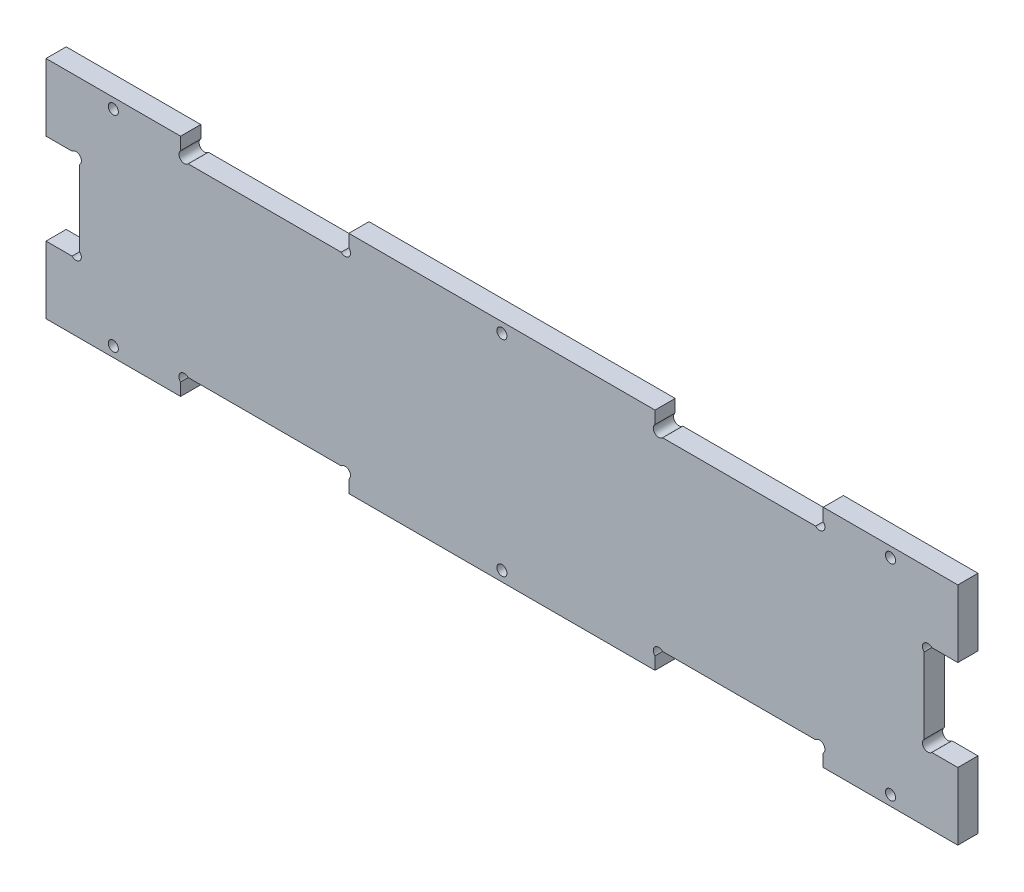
ISO-10303-21;
HEADER;
FILE_DESCRIPTION(('STEP AP214'),'2;1');
FILE_NAME('part.step','',(''),(''),'','','');
FILE_SCHEMA(('AUTOMOTIVE_DESIGN { 1 0 10303 214 1 1 1 1 }'));
ENDSEC;
DATA;
#1=APPLICATION_CONTEXT('core data for automotive mechanical design processes');
#2=APPLICATION_PROTOCOL_DEFINITION('international standard','automotive_design',2000,#1);
#3=PRODUCT_CONTEXT('',#1,'mechanical');
#4=PRODUCT('Part','Part','',(#3));
#5=PRODUCT_RELATED_PRODUCT_CATEGORY('part','',(#4));
#6=PRODUCT_DEFINITION_FORMATION('','',#4);
#7=PRODUCT_DEFINITION_CONTEXT('part definition',#1,'design');
#8=PRODUCT_DEFINITION('design','',#6,#7);
#9=PRODUCT_DEFINITION_SHAPE('','',#8);
#10=(LENGTH_UNIT() NAMED_UNIT(*) SI_UNIT(.MILLI.,.METRE.));
#11=(NAMED_UNIT(*) PLANE_ANGLE_UNIT() SI_UNIT($,.RADIAN.));
#12=(NAMED_UNIT(*) SI_UNIT($,.STERADIAN.) SOLID_ANGLE_UNIT());
#13=UNCERTAINTY_MEASURE_WITH_UNIT(LENGTH_MEASURE(1.E-05),#10,'distance_accuracy_value','');
#14=(GEOMETRIC_REPRESENTATION_CONTEXT(3) GLOBAL_UNCERTAINTY_ASSIGNED_CONTEXT((#13)) GLOBAL_UNIT_ASSIGNED_CONTEXT((#10,
#11,#12)) REPRESENTATION_CONTEXT('',''));
#15=CARTESIAN_POINT('',(0.,0.,0.));
#16=DIRECTION('',(0.,0.,1.));
#17=DIRECTION('',(1.,0.,0.));
#18=AXIS2_PLACEMENT_3D('',#15,#16,#17);
#19=CARTESIAN_POINT('',(-49.6617321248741,37.0001007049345,6.));
#20=DIRECTION('',(1.,0.,0.));
#21=DIRECTION('',(0.,1.,0.));
#22=AXIS2_PLACEMENT_3D('',#19,#20,#21);
#23=PLANE('',#22);
#24=DIRECTION('',(0.,-1.,0.));
#25=VECTOR('',#24,1.);
#26=CARTESIAN_POINT('',(-49.6617321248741,37.0001007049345,0.));
#27=LINE('',#26,#25);
#28=CARTESIAN_POINT('',(-49.6617321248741,43.0001007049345,0.));
#29=VERTEX_POINT('',#28);
#30=CARTESIAN_POINT('',(-49.6617321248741,23.0001007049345,0.));
#31=VERTEX_POINT('',#30);
#32=EDGE_CURVE('E480',#29,#31,#27,.T.);
#33=ORIENTED_EDGE('',*,*,#32,.T.);
#34=DIRECTION('',(0.,0.,1.));
#35=VECTOR('',#34,1.);
#36=CARTESIAN_POINT('',(-49.6617321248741,23.0001007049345,0.));
#37=LINE('',#36,#35);
#38=CARTESIAN_POINT('',(-49.6617321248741,23.0001007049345,6.));
#39=VERTEX_POINT('',#38);
#40=EDGE_CURVE('E324',#31,#39,#37,.T.);
#41=ORIENTED_EDGE('',*,*,#40,.T.);
#42=DIRECTION('',(0.,-1.,0.));
#43=VECTOR('',#42,1.);
#44=CARTESIAN_POINT('',(-49.6617321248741,37.0001007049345,6.));
#45=LINE('',#44,#43);
#46=CARTESIAN_POINT('',(-49.6617321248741,43.0001007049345,6.));
#47=VERTEX_POINT('',#46);
#48=EDGE_CURVE('E309',#47,#39,#45,.T.);
#49=ORIENTED_EDGE('',*,*,#48,.F.);
#50=DIRECTION('',(0.,0.,1.));
#51=VECTOR('',#50,1.);
#52=CARTESIAN_POINT('',(-49.6617321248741,43.0001007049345,6.));
#53=LINE('',#52,#51);
#54=EDGE_CURVE('E419',#29,#47,#53,.T.);
#55=ORIENTED_EDGE('',*,*,#54,.F.);
#56=EDGE_LOOP('',(#33,#41,#49,#55));
#57=FACE_BOUND('',#56,.T.);
#58=ADVANCED_FACE('F34',(#57),#23,.F.);
#59=CARTESIAN_POINT('',(221.338267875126,37.0001007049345,6.));
#60=DIRECTION('',(-1.,0.,0.));
#61=DIRECTION('',(0.,0.,1.));
#62=AXIS2_PLACEMENT_3D('',#59,#60,#61);
#63=PLANE('',#62);
#64=DIRECTION('',(0.,1.,0.));
#65=VECTOR('',#64,1.);
#66=CARTESIAN_POINT('',(221.338267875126,37.0001007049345,0.));
#67=LINE('',#66,#65);
#68=CARTESIAN_POINT('',(221.338267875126,-23.9998992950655,0.));
#69=VERTEX_POINT('',#68);
#70=CARTESIAN_POINT('',(221.338267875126,-3.99989929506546,0.));
#71=VERTEX_POINT('',#70);
#72=EDGE_CURVE('E487',#69,#71,#67,.T.);
#73=ORIENTED_EDGE('',*,*,#72,.T.);
#74=DIRECTION('',(0.,0.,1.));
#75=VECTOR('',#74,1.);
#76=CARTESIAN_POINT('',(221.338267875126,-3.99989929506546,0.));
#77=LINE('',#76,#75);
#78=CARTESIAN_POINT('',(221.338267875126,-3.99989929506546,6.));
#79=VERTEX_POINT('',#78);
#80=EDGE_CURVE('E342',#71,#79,#77,.T.);
#81=ORIENTED_EDGE('',*,*,#80,.T.);
#82=DIRECTION('',(0.,1.,0.));
#83=VECTOR('',#82,1.);
#84=CARTESIAN_POINT('',(221.338267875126,37.0001007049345,6.));
#85=LINE('',#84,#83);
#86=CARTESIAN_POINT('',(221.338267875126,-23.9998992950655,6.));
#87=VERTEX_POINT('',#86);
#88=EDGE_CURVE('E508',#87,#79,#85,.T.);
#89=ORIENTED_EDGE('',*,*,#88,.F.);
#90=DIRECTION('',(0.,0.,1.));
#91=VECTOR('',#90,1.);
#92=CARTESIAN_POINT('',(221.338267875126,-23.9998992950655,6.));
#93=LINE('',#92,#91);
#94=EDGE_CURVE('E474',#69,#87,#93,.T.);
#95=ORIENTED_EDGE('',*,*,#94,.F.);
#96=EDGE_LOOP('',(#73,#81,#89,#95));
#97=FACE_BOUND('',#96,.T.);
#98=ADVANCED_FACE('F702',(#97),#63,.F.);
#99=CARTESIAN_POINT('',(-49.6617321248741,37.0001007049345,6.));
#100=DIRECTION('',(0.,-1.,0.));
#101=DIRECTION('',(0.,0.,-1.));
#102=AXIS2_PLACEMENT_3D('',#99,#100,#101);
#103=PLANE('',#102);
#104=DIRECTION('',(-1.,0.,0.));
#105=VECTOR('',#104,1.);
#106=CARTESIAN_POINT('',(-49.6617321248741,37.0001007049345,6.));
#107=LINE('',#106,#105);
#108=CARTESIAN_POINT('',(179.076372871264,37.0001007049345,6.));
#109=VERTEX_POINT('',#108);
#110=CARTESIAN_POINT('',(133.600162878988,37.0001007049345,6.));
#111=VERTEX_POINT('',#110);
#112=EDGE_CURVE('E540',#109,#111,#107,.T.);
#113=ORIENTED_EDGE('',*,*,#112,.F.);
#114=DIRECTION('',(0.,0.,1.));
#115=VECTOR('',#114,1.);
#116=CARTESIAN_POINT('',(179.076372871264,37.0001007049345,0.));
#117=LINE('',#116,#115);
#118=CARTESIAN_POINT('',(179.076372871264,37.0001007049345,0.));
#119=VERTEX_POINT('',#118);
#120=EDGE_CURVE('E629',#109,#119,#117,.F.);
#121=ORIENTED_EDGE('',*,*,#120,.T.);
#122=DIRECTION('',(-1.,0.,0.));
#123=VECTOR('',#122,1.);
#124=CARTESIAN_POINT('',(-49.6617321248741,37.0001007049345,0.));
#125=LINE('',#124,#123);
#126=CARTESIAN_POINT('',(133.600162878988,37.0001007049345,0.));
#127=VERTEX_POINT('',#126);
#128=EDGE_CURVE('E544',#119,#127,#125,.T.);
#129=ORIENTED_EDGE('',*,*,#128,.T.);
#130=DIRECTION('',(0.,0.,1.));
#131=VECTOR('',#130,1.);
#132=CARTESIAN_POINT('',(133.600162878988,37.0001007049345,0.));
#133=LINE('',#132,#131);
#134=EDGE_CURVE('E586',#127,#111,#133,.T.);
#135=ORIENTED_EDGE('',*,*,#134,.T.);
#136=EDGE_LOOP('',(#113,#121,#129,#135));
#137=FACE_BOUND('',#136,.T.);
#138=ADVANCED_FACE('F784',(#137),#103,.F.);
#139=CARTESIAN_POINT('',(38.0763728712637,37.0001007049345,6.));
#140=VERTEX_POINT('',#139);
#141=CARTESIAN_POINT('',(-7.39983712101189,37.0001007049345,6.));
#142=VERTEX_POINT('',#141);
#143=EDGE_CURVE('E545',#140,#142,#107,.T.);
#144=ORIENTED_EDGE('',*,*,#143,.F.);
#145=DIRECTION('',(0.,0.,1.));
#146=VECTOR('',#145,1.);
#147=CARTESIAN_POINT('',(38.0763728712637,37.0001007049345,0.));
#148=LINE('',#147,#146);
#149=CARTESIAN_POINT('',(38.0763728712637,37.0001007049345,0.));
#150=VERTEX_POINT('',#149);
#151=EDGE_CURVE('E645',#140,#150,#148,.F.);
#152=ORIENTED_EDGE('',*,*,#151,.T.);
#153=CARTESIAN_POINT('',(-7.39983712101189,37.0001007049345,0.));
#154=VERTEX_POINT('',#153);
#155=EDGE_CURVE('E542',#150,#154,#125,.T.);
#156=ORIENTED_EDGE('',*,*,#155,.T.);
#157=DIRECTION('',(0.,0.,1.));
#158=VECTOR('',#157,1.);
#159=CARTESIAN_POINT('',(-7.39983712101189,37.0001007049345,0.));
#160=LINE('',#159,#158);
#161=EDGE_CURVE('E636',#154,#142,#160,.T.);
#162=ORIENTED_EDGE('',*,*,#161,.T.);
#163=EDGE_LOOP('',(#144,#152,#156,#162));
#164=FACE_BOUND('',#163,.T.);
#165=ADVANCED_FACE('F794',(#164),#103,.F.);
#166=CARTESIAN_POINT('',(221.338267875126,-17.9998992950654,6.));
#167=DIRECTION('',(0.,1.,0.));
#168=DIRECTION('',(-1.,0.,0.));
#169=AXIS2_PLACEMENT_3D('',#166,#167,#168);
#170=PLANE('',#169);
#171=DIRECTION('',(1.,0.,0.));
#172=VECTOR('',#171,1.);
#173=CARTESIAN_POINT('',(221.338267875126,-17.9998992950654,6.));
#174=LINE('',#173,#172);
#175=CARTESIAN_POINT('',(-7.39983712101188,-17.9998992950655,6.));
#176=VERTEX_POINT('',#175);
#177=CARTESIAN_POINT('',(38.0763728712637,-17.9998992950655,6.));
#178=VERTEX_POINT('',#177);
#179=EDGE_CURVE('E502',#176,#178,#174,.T.);
#180=ORIENTED_EDGE('',*,*,#179,.F.);
#181=DIRECTION('',(0.,0.,1.));
#182=VECTOR('',#181,1.);
#183=CARTESIAN_POINT('',(-7.39983712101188,-17.9998992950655,0.));
#184=LINE('',#183,#182);
#185=CARTESIAN_POINT('',(-7.39983712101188,-17.9998992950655,0.));
#186=VERTEX_POINT('',#185);
#187=EDGE_CURVE('E592',#176,#186,#184,.F.);
#188=ORIENTED_EDGE('',*,*,#187,.T.);
#189=DIRECTION('',(1.,0.,0.));
#190=VECTOR('',#189,1.);
#191=CARTESIAN_POINT('',(221.338267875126,-17.9998992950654,0.));
#192=LINE('',#191,#190);
#193=CARTESIAN_POINT('',(38.0763728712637,-17.9998992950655,0.));
#194=VERTEX_POINT('',#193);
#195=EDGE_CURVE('E491',#186,#194,#192,.T.);
#196=ORIENTED_EDGE('',*,*,#195,.T.);
#197=DIRECTION('',(0.,0.,1.));
#198=VECTOR('',#197,1.);
#199=CARTESIAN_POINT('',(38.0763728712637,-17.9998992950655,0.));
#200=LINE('',#199,#198);
#201=EDGE_CURVE('E594',#194,#178,#200,.T.);
#202=ORIENTED_EDGE('',*,*,#201,.T.);
#203=EDGE_LOOP('',(#180,#188,#196,#202));
#204=FACE_BOUND('',#203,.T.);
#205=ADVANCED_FACE('F591',(#204),#170,.F.);
#206=CARTESIAN_POINT('',(133.600162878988,-17.9998992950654,6.));
#207=VERTEX_POINT('',#206);
#208=CARTESIAN_POINT('',(179.076372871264,-17.9998992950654,6.));
#209=VERTEX_POINT('',#208);
#210=EDGE_CURVE('E499',#207,#209,#174,.T.);
#211=ORIENTED_EDGE('',*,*,#210,.F.);
#212=DIRECTION('',(0.,0.,1.));
#213=VECTOR('',#212,1.);
#214=CARTESIAN_POINT('',(133.600162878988,-17.9998992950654,0.));
#215=LINE('',#214,#213);
#216=CARTESIAN_POINT('',(133.600162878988,-17.9998992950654,0.));
#217=VERTEX_POINT('',#216);
#218=EDGE_CURVE('E621',#207,#217,#215,.F.);
#219=ORIENTED_EDGE('',*,*,#218,.T.);
#220=CARTESIAN_POINT('',(179.076372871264,-17.9998992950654,0.));
#221=VERTEX_POINT('',#220);
#222=EDGE_CURVE('E483',#217,#221,#192,.T.);
#223=ORIENTED_EDGE('',*,*,#222,.T.);
#224=DIRECTION('',(0.,0.,1.));
#225=VECTOR('',#224,1.);
#226=CARTESIAN_POINT('',(179.076372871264,-17.9998992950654,0.));
#227=LINE('',#226,#225);
#228=EDGE_CURVE('E612',#221,#209,#227,.T.);
#229=ORIENTED_EDGE('',*,*,#228,.T.);
#230=EDGE_LOOP('',(#211,#219,#223,#229));
#231=FACE_BOUND('',#230,.T.);
#232=ADVANCED_FACE('F756',(#231),#170,.F.);
#233=CARTESIAN_POINT('',(-49.6617321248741,-3.99989929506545,6.));
#234=VERTEX_POINT('',#233);
#235=CARTESIAN_POINT('',(-49.6617321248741,-23.9998992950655,6.));
#236=VERTEX_POINT('',#235);
#237=EDGE_CURVE('E549',#234,#236,#45,.T.);
#238=ORIENTED_EDGE('',*,*,#237,.F.);
#239=DIRECTION('',(0.,0.,1.));
#240=VECTOR('',#239,1.);
#241=CARTESIAN_POINT('',(-49.6617321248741,-3.99989929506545,0.));
#242=LINE('',#241,#240);
#243=CARTESIAN_POINT('',(-49.6617321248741,-3.99989929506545,0.));
#244=VERTEX_POINT('',#243);
#245=EDGE_CURVE('E323',#244,#234,#242,.T.);
#246=ORIENTED_EDGE('',*,*,#245,.F.);
#247=CARTESIAN_POINT('',(-49.6617321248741,-23.9998992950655,0.));
#248=VERTEX_POINT('',#247);
#249=EDGE_CURVE('E484',#244,#248,#27,.T.);
#250=ORIENTED_EDGE('',*,*,#249,.T.);
#251=DIRECTION('',(0.,0.,-1.));
#252=VECTOR('',#251,1.);
#253=CARTESIAN_POINT('',(-49.6617321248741,-23.9998992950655,6.));
#254=LINE('',#253,#252);
#255=EDGE_CURVE('E452',#236,#248,#254,.T.);
#256=ORIENTED_EDGE('',*,*,#255,.F.);
#257=EDGE_LOOP('',(#238,#246,#250,#256));
#258=FACE_BOUND('',#257,.T.);
#259=ADVANCED_FACE('F36',(#258),#23,.F.);
#260=CARTESIAN_POINT('',(221.338267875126,23.0001007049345,6.));
#261=VERTEX_POINT('',#260);
#262=CARTESIAN_POINT('',(221.338267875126,43.0001007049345,6.));
#263=VERTEX_POINT('',#262);
#264=EDGE_CURVE('E512',#261,#263,#85,.T.);
#265=ORIENTED_EDGE('',*,*,#264,.F.);
#266=DIRECTION('',(0.,0.,1.));
#267=VECTOR('',#266,1.);
#268=CARTESIAN_POINT('',(221.338267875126,23.0001007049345,0.));
#269=LINE('',#268,#267);
#270=CARTESIAN_POINT('',(221.338267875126,23.0001007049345,0.));
#271=VERTEX_POINT('',#270);
#272=EDGE_CURVE('E341',#271,#261,#269,.T.);
#273=ORIENTED_EDGE('',*,*,#272,.F.);
#274=CARTESIAN_POINT('',(221.338267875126,43.0001007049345,0.));
#275=VERTEX_POINT('',#274);
#276=EDGE_CURVE('E704',#271,#275,#67,.T.);
#277=ORIENTED_EDGE('',*,*,#276,.T.);
#278=DIRECTION('',(0.,0.,-1.));
#279=VECTOR('',#278,1.);
#280=CARTESIAN_POINT('',(221.338267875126,43.0001007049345,6.));
#281=LINE('',#280,#279);
#282=EDGE_CURVE('E382',#263,#275,#281,.T.);
#283=ORIENTED_EDGE('',*,*,#282,.F.);
#284=EDGE_LOOP('',(#265,#273,#277,#283));
#285=FACE_BOUND('',#284,.T.);
#286=ADVANCED_FACE('F711',(#285),#63,.F.);
#287=CARTESIAN_POINT('',(-49.6617321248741,-17.9998992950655,6.));
#288=DIRECTION('',(0.,0.,-1.));
#289=DIRECTION('',(-1.,0.,0.));
#290=AXIS2_PLACEMENT_3D('',#287,#288,#289);
#291=PLANE('',#290);
#292=CARTESIAN_POINT('',(201.338267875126,40.0001007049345,6.));
#293=DIRECTION('',(0.,0.,1.));
#294=DIRECTION('',(1.,0.,0.));
#295=AXIS2_PLACEMENT_3D('',#292,#293,#294);
#296=CIRCLE('',#295,1.5);
#297=CARTESIAN_POINT('',(202.838267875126,40.0001007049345,6.));
#298=VERTEX_POINT('',#297);
#299=EDGE_CURVE('E345',#298,#298,#296,.T.);
#300=ORIENTED_EDGE('',*,*,#299,.F.);
#301=EDGE_LOOP('',(#300));
#302=FACE_BOUND('',#301,.T.);
#303=CARTESIAN_POINT('',(85.8382678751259,40.0001007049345,6.));
#304=DIRECTION('',(0.,0.,1.));
#305=DIRECTION('',(1.,0.,0.));
#306=AXIS2_PLACEMENT_3D('',#303,#304,#305);
#307=CIRCLE('',#306,1.5);
#308=CARTESIAN_POINT('',(87.3382678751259,40.0001007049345,6.));
#309=VERTEX_POINT('',#308);
#310=EDGE_CURVE('E352',#309,#309,#307,.T.);
#311=ORIENTED_EDGE('',*,*,#310,.F.);
#312=EDGE_LOOP('',(#311));
#313=FACE_BOUND('',#312,.T.);
#314=CARTESIAN_POINT('',(-29.6617321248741,40.0001007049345,6.));
#315=DIRECTION('',(0.,0.,1.));
#316=DIRECTION('',(1.,0.,0.));
#317=AXIS2_PLACEMENT_3D('',#314,#315,#316);
#318=CIRCLE('',#317,1.5);
#319=CARTESIAN_POINT('',(-28.1617321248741,40.0001007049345,6.));
#320=VERTEX_POINT('',#319);
#321=EDGE_CURVE('E358',#320,#320,#318,.T.);
#322=ORIENTED_EDGE('',*,*,#321,.F.);
#323=EDGE_LOOP('',(#322));
#324=FACE_BOUND('',#323,.T.);
#325=CARTESIAN_POINT('',(-29.6617321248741,-20.9998992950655,6.));
#326=DIRECTION('',(0.,0.,1.));
#327=DIRECTION('',(1.,0.,0.));
#328=AXIS2_PLACEMENT_3D('',#325,#326,#327);
#329=CIRCLE('',#328,1.5);
#330=CARTESIAN_POINT('',(-28.1617321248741,-20.9998992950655,6.));
#331=VERTEX_POINT('',#330);
#332=EDGE_CURVE('E364',#331,#331,#329,.T.);
#333=ORIENTED_EDGE('',*,*,#332,.F.);
#334=EDGE_LOOP('',(#333));
#335=FACE_BOUND('',#334,.T.);
#336=CARTESIAN_POINT('',(85.8382678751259,-20.9998992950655,6.));
#337=DIRECTION('',(0.,0.,1.));
#338=DIRECTION('',(1.,0.,0.));
#339=AXIS2_PLACEMENT_3D('',#336,#337,#338);
#340=CIRCLE('',#339,1.5);
#341=CARTESIAN_POINT('',(87.3382678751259,-20.9998992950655,6.));
#342=VERTEX_POINT('',#341);
#343=EDGE_CURVE('E370',#342,#342,#340,.T.);
#344=ORIENTED_EDGE('',*,*,#343,.F.);
#345=EDGE_LOOP('',(#344));
#346=FACE_BOUND('',#345,.T.);
#347=CARTESIAN_POINT('',(201.338267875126,-20.9998992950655,6.));
#348=DIRECTION('',(0.,0.,1.));
#349=DIRECTION('',(1.,0.,0.));
#350=AXIS2_PLACEMENT_3D('',#347,#348,#349);
#351=CIRCLE('',#350,1.5);
#352=CARTESIAN_POINT('',(202.838267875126,-20.9998992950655,6.));
#353=VERTEX_POINT('',#352);
#354=EDGE_CURVE('E376',#353,#353,#351,.T.);
#355=ORIENTED_EDGE('',*,*,#354,.F.);
#356=EDGE_LOOP('',(#355));
#357=FACE_BOUND('',#356,.T.);
#358=DIRECTION('',(-1.,0.,0.));
#359=VECTOR('',#358,1.);
#360=CARTESIAN_POINT('',(-49.6617321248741,23.0001007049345,6.));
#361=LINE('',#360,#359);
#362=CARTESIAN_POINT('',(-41.9236271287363,23.0001007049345,6.));
#363=VERTEX_POINT('',#362);
#364=EDGE_CURVE('E301',#363,#39,#361,.T.);
#365=ORIENTED_EDGE('',*,*,#364,.F.);
#366=CARTESIAN_POINT('',(-40.7617321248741,21.9001007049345,6.));
#367=DIRECTION('',(0.,0.,1.));
#368=DIRECTION('',(1.,0.,0.));
#369=AXIS2_PLACEMENT_3D('',#366,#367,#368);
#370=CIRCLE('',#369,1.6);
#371=CARTESIAN_POINT('',(-39.6617321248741,20.7382057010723,6.));
#372=VERTEX_POINT('',#371);
#373=EDGE_CURVE('E288',#372,#363,#370,.T.);
#374=ORIENTED_EDGE('',*,*,#373,.F.);
#375=DIRECTION('',(0.,1.,0.));
#376=VECTOR('',#375,1.);
#377=CARTESIAN_POINT('',(-39.6617321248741,-3.99989929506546,6.));
#378=LINE('',#377,#376);
#379=CARTESIAN_POINT('',(-39.6617321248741,-1.73800429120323,6.));
#380=VERTEX_POINT('',#379);
#381=EDGE_CURVE('E311',#380,#372,#378,.T.);
#382=ORIENTED_EDGE('',*,*,#381,.F.);
#383=CARTESIAN_POINT('',(-40.7617321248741,-2.89989929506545,6.));
#384=DIRECTION('',(0.,0.,1.));
#385=DIRECTION('',(1.,0.,0.));
#386=AXIS2_PLACEMENT_3D('',#383,#384,#385);
#387=CIRCLE('',#386,1.6);
#388=CARTESIAN_POINT('',(-41.9236271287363,-3.99989929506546,6.));
#389=VERTEX_POINT('',#388);
#390=EDGE_CURVE('E304',#389,#380,#387,.T.);
#391=ORIENTED_EDGE('',*,*,#390,.F.);
#392=DIRECTION('',(1.,0.,0.));
#393=VECTOR('',#392,1.);
#394=CARTESIAN_POINT('',(-49.6617321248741,-3.99989929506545,6.));
#395=LINE('',#394,#393);
#396=EDGE_CURVE('E316',#234,#389,#395,.T.);
#397=ORIENTED_EDGE('',*,*,#396,.F.);
#398=ORIENTED_EDGE('',*,*,#237,.T.);
#399=DIRECTION('',(-1.,0.,0.));
#400=VECTOR('',#399,1.);
#401=CARTESIAN_POINT('',(-49.6617321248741,-23.9998992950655,6.));
#402=LINE('',#401,#400);
#403=CARTESIAN_POINT('',(-9.6617321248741,-23.9998992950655,6.));
#404=VERTEX_POINT('',#403);
#405=EDGE_CURVE('E459',#404,#236,#402,.T.);
#406=ORIENTED_EDGE('',*,*,#405,.F.);
#407=DIRECTION('',(0.,1.,0.));
#408=VECTOR('',#407,1.);
#409=CARTESIAN_POINT('',(-9.6617321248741,-23.9998992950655,6.));
#410=LINE('',#409,#408);
#411=CARTESIAN_POINT('',(-9.6617321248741,-20.2617942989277,6.));
#412=VERTEX_POINT('',#411);
#413=EDGE_CURVE('E462',#404,#412,#410,.T.);
#414=ORIENTED_EDGE('',*,*,#413,.T.);
#415=CARTESIAN_POINT('',(-8.5617321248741,-19.0998992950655,6.));
#416=DIRECTION('',(0.,0.,1.));
#417=DIRECTION('',(1.,0.,0.));
#418=AXIS2_PLACEMENT_3D('',#415,#416,#417);
#419=CIRCLE('',#418,1.6);
#420=EDGE_CURVE('E581',#176,#412,#419,.T.);
#421=ORIENTED_EDGE('',*,*,#420,.F.);
#422=ORIENTED_EDGE('',*,*,#179,.T.);
#423=CARTESIAN_POINT('',(39.2382678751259,-19.0998992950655,6.));
#424=DIRECTION('',(0.,0.,1.));
#425=DIRECTION('',(1.,0.,0.));
#426=AXIS2_PLACEMENT_3D('',#423,#424,#425);
#427=CIRCLE('',#426,1.6);
#428=CARTESIAN_POINT('',(40.3382678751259,-20.2617942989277,6.));
#429=VERTEX_POINT('',#428);
#430=EDGE_CURVE('E599',#429,#178,#427,.T.);
#431=ORIENTED_EDGE('',*,*,#430,.F.);
#432=DIRECTION('',(0.,1.,0.));
#433=VECTOR('',#432,1.);
#434=CARTESIAN_POINT('',(40.3382678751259,-23.9998992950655,6.));
#435=LINE('',#434,#433);
#436=CARTESIAN_POINT('',(40.3382678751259,-23.9998992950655,6.));
#437=VERTEX_POINT('',#436);
#438=EDGE_CURVE('E440',#437,#429,#435,.T.);
#439=ORIENTED_EDGE('',*,*,#438,.F.);
#440=DIRECTION('',(-1.,0.,0.));
#441=VECTOR('',#440,1.);
#442=CARTESIAN_POINT('',(40.3382678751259,-23.9998992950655,6.));
#443=LINE('',#442,#441);
#444=CARTESIAN_POINT('',(131.338267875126,-23.9998992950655,6.));
#445=VERTEX_POINT('',#444);
#446=EDGE_CURVE('E438',#445,#437,#443,.T.);
#447=ORIENTED_EDGE('',*,*,#446,.F.);
#448=DIRECTION('',(0.,1.,0.));
#449=VECTOR('',#448,1.);
#450=CARTESIAN_POINT('',(131.338267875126,-23.9998992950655,6.));
#451=LINE('',#450,#449);
#452=CARTESIAN_POINT('',(131.338267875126,-20.2617942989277,6.));
#453=VERTEX_POINT('',#452);
#454=EDGE_CURVE('E443',#445,#453,#451,.T.);
#455=ORIENTED_EDGE('',*,*,#454,.T.);
#456=CARTESIAN_POINT('',(132.438267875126,-19.0998992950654,6.));
#457=DIRECTION('',(0.,0.,1.));
#458=DIRECTION('',(1.,0.,0.));
#459=AXIS2_PLACEMENT_3D('',#456,#457,#458);
#460=CIRCLE('',#459,1.59999999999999);
#461=EDGE_CURVE('E627',#207,#453,#460,.T.);
#462=ORIENTED_EDGE('',*,*,#461,.F.);
#463=ORIENTED_EDGE('',*,*,#210,.T.);
#464=CARTESIAN_POINT('',(180.238267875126,-19.0998992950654,6.));
#465=DIRECTION('',(0.,0.,1.));
#466=DIRECTION('',(1.,0.,0.));
#467=AXIS2_PLACEMENT_3D('',#464,#465,#466);
#468=CIRCLE('',#467,1.59999999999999);
#469=CARTESIAN_POINT('',(181.338267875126,-20.2617942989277,6.));
#470=VERTEX_POINT('',#469);
#471=EDGE_CURVE('E618',#470,#209,#468,.T.);
#472=ORIENTED_EDGE('',*,*,#471,.F.);
#473=DIRECTION('',(0.,1.,0.));
#474=VECTOR('',#473,1.);
#475=CARTESIAN_POINT('',(181.338267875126,-23.9998992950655,6.));
#476=LINE('',#475,#474);
#477=CARTESIAN_POINT('',(181.338267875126,-23.9998992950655,6.));
#478=VERTEX_POINT('',#477);
#479=EDGE_CURVE('E479',#478,#470,#476,.T.);
#480=ORIENTED_EDGE('',*,*,#479,.F.);
#481=DIRECTION('',(-1.,0.,0.));
#482=VECTOR('',#481,1.);
#483=CARTESIAN_POINT('',(181.338267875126,-23.9998992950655,6.));
#484=LINE('',#483,#482);
#485=EDGE_CURVE('E477',#87,#478,#484,.T.);
#486=ORIENTED_EDGE('',*,*,#485,.F.);
#487=ORIENTED_EDGE('',*,*,#88,.T.);
#488=DIRECTION('',(1.,0.,0.));
#489=VECTOR('',#488,1.);
#490=CARTESIAN_POINT('',(221.338267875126,-3.99989929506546,6.));
#491=LINE('',#490,#489);
#492=CARTESIAN_POINT('',(213.600162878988,-3.99989929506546,6.));
#493=VERTEX_POINT('',#492);
#494=EDGE_CURVE('E332',#493,#79,#491,.T.);
#495=ORIENTED_EDGE('',*,*,#494,.F.);
#496=CARTESIAN_POINT('',(212.438267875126,-2.89989929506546,6.));
#497=DIRECTION('',(0.,0.,1.));
#498=DIRECTION('',(1.,0.,0.));
#499=AXIS2_PLACEMENT_3D('',#496,#497,#498);
#500=CIRCLE('',#499,1.59999999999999);
#501=CARTESIAN_POINT('',(211.338267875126,-1.73800429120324,6.));
#502=VERTEX_POINT('',#501);
#503=EDGE_CURVE('E659',#502,#493,#500,.T.);
#504=ORIENTED_EDGE('',*,*,#503,.F.);
#505=DIRECTION('',(0.,-1.,0.));
#506=VECTOR('',#505,1.);
#507=CARTESIAN_POINT('',(211.338267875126,-3.99989929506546,6.));
#508=LINE('',#507,#506);
#509=CARTESIAN_POINT('',(211.338267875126,20.7382057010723,6.));
#510=VERTEX_POINT('',#509);
#511=EDGE_CURVE('E330',#510,#502,#508,.T.);
#512=ORIENTED_EDGE('',*,*,#511,.F.);
#513=CARTESIAN_POINT('',(212.438267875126,21.9001007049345,6.));
#514=DIRECTION('',(0.,0.,1.));
#515=DIRECTION('',(1.,0.,0.));
#516=AXIS2_PLACEMENT_3D('',#513,#514,#515);
#517=CIRCLE('',#516,1.59999999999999);
#518=CARTESIAN_POINT('',(213.600162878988,23.0001007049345,6.));
#519=VERTEX_POINT('',#518);
#520=EDGE_CURVE('E667',#519,#510,#517,.T.);
#521=ORIENTED_EDGE('',*,*,#520,.F.);
#522=DIRECTION('',(-1.,0.,0.));
#523=VECTOR('',#522,1.);
#524=CARTESIAN_POINT('',(221.338267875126,23.0001007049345,6.));
#525=LINE('',#524,#523);
#526=EDGE_CURVE('E326',#261,#519,#525,.T.);
#527=ORIENTED_EDGE('',*,*,#526,.F.);
#528=ORIENTED_EDGE('',*,*,#264,.T.);
#529=DIRECTION('',(1.,0.,0.));
#530=VECTOR('',#529,1.);
#531=CARTESIAN_POINT('',(221.338267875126,43.0001007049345,6.));
#532=LINE('',#531,#530);
#533=CARTESIAN_POINT('',(181.338267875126,43.0001007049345,6.));
#534=VERTEX_POINT('',#533);
#535=EDGE_CURVE('E389',#534,#263,#532,.T.);
#536=ORIENTED_EDGE('',*,*,#535,.F.);
#537=DIRECTION('',(0.,-1.,0.));
#538=VECTOR('',#537,1.);
#539=CARTESIAN_POINT('',(181.338267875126,43.0001007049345,6.));
#540=LINE('',#539,#538);
#541=CARTESIAN_POINT('',(181.338267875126,39.2619957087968,6.));
#542=VERTEX_POINT('',#541);
#543=EDGE_CURVE('E392',#534,#542,#540,.T.);
#544=ORIENTED_EDGE('',*,*,#543,.T.);
#545=CARTESIAN_POINT('',(180.238267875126,38.1001007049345,6.));
#546=DIRECTION('',(0.,0.,1.));
#547=DIRECTION('',(1.,0.,0.));
#548=AXIS2_PLACEMENT_3D('',#545,#546,#547);
#549=CIRCLE('',#548,1.59999999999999);
#550=EDGE_CURVE('E634',#109,#542,#549,.T.);
#551=ORIENTED_EDGE('',*,*,#550,.F.);
#552=ORIENTED_EDGE('',*,*,#112,.T.);
#553=CARTESIAN_POINT('',(132.438267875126,38.1001007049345,6.));
#554=DIRECTION('',(0.,0.,1.));
#555=DIRECTION('',(1.,0.,0.));
#556=AXIS2_PLACEMENT_3D('',#553,#554,#555);
#557=CIRCLE('',#556,1.59999999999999);
#558=CARTESIAN_POINT('',(131.338267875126,39.2619957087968,6.));
#559=VERTEX_POINT('',#558);
#560=EDGE_CURVE('E609',#559,#111,#557,.T.);
#561=ORIENTED_EDGE('',*,*,#560,.F.);
#562=DIRECTION('',(0.,-1.,0.));
#563=VECTOR('',#562,1.);
#564=CARTESIAN_POINT('',(131.338267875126,43.0001007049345,5.99999999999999));
#565=LINE('',#564,#563);
#566=CARTESIAN_POINT('',(131.338267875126,43.0001007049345,5.99999999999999));
#567=VERTEX_POINT('',#566);
#568=EDGE_CURVE('E413',#567,#559,#565,.T.);
#569=ORIENTED_EDGE('',*,*,#568,.F.);
#570=DIRECTION('',(1.,0.,0.));
#571=VECTOR('',#570,1.);
#572=CARTESIAN_POINT('',(40.3382678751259,43.0001007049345,6.));
#573=LINE('',#572,#571);
#574=CARTESIAN_POINT('',(40.3382678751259,43.0001007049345,6.));
#575=VERTEX_POINT('',#574);
#576=EDGE_CURVE('E401',#575,#567,#573,.T.);
#577=ORIENTED_EDGE('',*,*,#576,.F.);
#578=DIRECTION('',(0.,-1.,0.));
#579=VECTOR('',#578,1.);
#580=CARTESIAN_POINT('',(40.3382678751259,43.0001007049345,6.));
#581=LINE('',#580,#579);
#582=CARTESIAN_POINT('',(40.3382678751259,39.2619957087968,6.));
#583=VERTEX_POINT('',#582);
#584=EDGE_CURVE('E416',#575,#583,#581,.T.);
#585=ORIENTED_EDGE('',*,*,#584,.T.);
#586=CARTESIAN_POINT('',(39.2382678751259,38.1001007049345,6.));
#587=DIRECTION('',(0.,0.,1.));
#588=DIRECTION('',(1.,0.,0.));
#589=AXIS2_PLACEMENT_3D('',#586,#587,#588);
#590=CIRCLE('',#589,1.6);
#591=EDGE_CURVE('E651',#140,#583,#590,.T.);
#592=ORIENTED_EDGE('',*,*,#591,.F.);
#593=ORIENTED_EDGE('',*,*,#143,.T.);
#594=CARTESIAN_POINT('',(-8.56173212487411,38.1001007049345,6.));
#595=DIRECTION('',(0.,0.,1.));
#596=DIRECTION('',(1.,0.,0.));
#597=AXIS2_PLACEMENT_3D('',#594,#595,#596);
#598=CIRCLE('',#597,1.6);
#599=CARTESIAN_POINT('',(-9.66173212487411,39.2619957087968,6.));
#600=VERTEX_POINT('',#599);
#601=EDGE_CURVE('E642',#600,#142,#598,.T.);
#602=ORIENTED_EDGE('',*,*,#601,.F.);
#603=DIRECTION('',(0.,-1.,0.));
#604=VECTOR('',#603,1.);
#605=CARTESIAN_POINT('',(-9.66173212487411,43.0001007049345,5.99999999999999));
#606=LINE('',#605,#604);
#607=CARTESIAN_POINT('',(-9.66173212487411,43.0001007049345,5.99999999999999));
#608=VERTEX_POINT('',#607);
#609=EDGE_CURVE('E434',#608,#600,#606,.T.);
#610=ORIENTED_EDGE('',*,*,#609,.F.);
#611=DIRECTION('',(1.,0.,0.));
#612=VECTOR('',#611,1.);
#613=CARTESIAN_POINT('',(-49.6617321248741,43.0001007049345,6.));
#614=LINE('',#613,#612);
#615=EDGE_CURVE('E422',#47,#608,#614,.T.);
#616=ORIENTED_EDGE('',*,*,#615,.F.);
#617=ORIENTED_EDGE('',*,*,#48,.T.);
#618=EDGE_LOOP('',(#365,#374,#382,#391,#397,#398,#406,#414,#421,#422,#431,#439,#447,#455,#462,
#463,#472,#480,#486,#487,#495,#504,#512,#521,#527,#528,#536,#544,#551,#552,#561,#569,#577,#585,
#592,#593,#602,#610,#616,#617));
#619=FACE_BOUND('',#618,.T.);
#620=ADVANCED_FACE('F307',(#302,#313,#324,#335,#346,#357,#619),#291,.F.);
#621=CARTESIAN_POINT('',(-49.6617321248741,-17.9998992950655,0.));
#622=DIRECTION('',(0.,0.,-1.));
#623=DIRECTION('',(-1.,0.,0.));
#624=AXIS2_PLACEMENT_3D('',#621,#622,#623);
#625=PLANE('',#624);
#626=CARTESIAN_POINT('',(-40.7617321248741,21.9001007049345,0.));
#627=DIRECTION('',(0.,0.,1.));
#628=DIRECTION('',(1.,0.,0.));
#629=AXIS2_PLACEMENT_3D('',#626,#627,#628);
#630=CIRCLE('',#629,1.6);
#631=CARTESIAN_POINT('',(-39.6617321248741,20.7382057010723,0.));
#632=VERTEX_POINT('',#631);
#633=CARTESIAN_POINT('',(-41.9236271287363,23.0001007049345,0.));
#634=VERTEX_POINT('',#633);
#635=EDGE_CURVE('E49',#632,#634,#630,.T.);
#636=ORIENTED_EDGE('',*,*,#635,.T.);
#637=DIRECTION('',(-1.,0.,0.));
#638=VECTOR('',#637,1.);
#639=CARTESIAN_POINT('',(-49.6617321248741,23.0001007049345,0.));
#640=LINE('',#639,#638);
#641=EDGE_CURVE('E303',#634,#31,#640,.T.);
#642=ORIENTED_EDGE('',*,*,#641,.T.);
#643=ORIENTED_EDGE('',*,*,#32,.F.);
#644=DIRECTION('',(-1.,0.,0.));
#645=VECTOR('',#644,1.);
#646=CARTESIAN_POINT('',(-49.6617321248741,43.0001007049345,0.));
#647=LINE('',#646,#645);
#648=CARTESIAN_POINT('',(-9.66173212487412,43.0001007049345,0.));
#649=VERTEX_POINT('',#648);
#650=EDGE_CURVE('E426',#649,#29,#647,.T.);
#651=ORIENTED_EDGE('',*,*,#650,.F.);
#652=DIRECTION('',(0.,-1.,0.));
#653=VECTOR('',#652,1.);
#654=CARTESIAN_POINT('',(-9.66173212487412,43.0001007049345,0.));
#655=LINE('',#654,#653);
#656=CARTESIAN_POINT('',(-9.66173212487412,39.2619957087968,0.));
#657=VERTEX_POINT('',#656);
#658=EDGE_CURVE('E429',#649,#657,#655,.T.);
#659=ORIENTED_EDGE('',*,*,#658,.T.);
#660=CARTESIAN_POINT('',(-8.56173212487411,38.1001007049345,0.));
#661=DIRECTION('',(0.,0.,1.));
#662=DIRECTION('',(1.,0.,0.));
#663=AXIS2_PLACEMENT_3D('',#660,#661,#662);
#664=CIRCLE('',#663,1.6);
#665=EDGE_CURVE('E639',#657,#154,#664,.T.);
#666=ORIENTED_EDGE('',*,*,#665,.T.);
#667=ORIENTED_EDGE('',*,*,#155,.F.);
#668=CARTESIAN_POINT('',(39.2382678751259,38.1001007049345,0.));
#669=DIRECTION('',(0.,0.,1.));
#670=DIRECTION('',(1.,0.,0.));
#671=AXIS2_PLACEMENT_3D('',#668,#669,#670);
#672=CIRCLE('',#671,1.6);
#673=CARTESIAN_POINT('',(40.3382678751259,39.2619957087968,0.));
#674=VERTEX_POINT('',#673);
#675=EDGE_CURVE('E648',#150,#674,#672,.T.);
#676=ORIENTED_EDGE('',*,*,#675,.T.);
#677=DIRECTION('',(0.,-1.,0.));
#678=VECTOR('',#677,1.);
#679=CARTESIAN_POINT('',(40.3382678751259,43.0001007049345,0.));
#680=LINE('',#679,#678);
#681=CARTESIAN_POINT('',(40.3382678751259,43.0001007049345,0.));
#682=VERTEX_POINT('',#681);
#683=EDGE_CURVE('E407',#682,#674,#680,.T.);
#684=ORIENTED_EDGE('',*,*,#683,.F.);
#685=DIRECTION('',(-1.,0.,0.));
#686=VECTOR('',#685,1.);
#687=CARTESIAN_POINT('',(40.3382678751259,43.0001007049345,0.));
#688=LINE('',#687,#686);
#689=CARTESIAN_POINT('',(131.338267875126,43.0001007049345,0.));
#690=VERTEX_POINT('',#689);
#691=EDGE_CURVE('E405',#690,#682,#688,.T.);
#692=ORIENTED_EDGE('',*,*,#691,.F.);
#693=DIRECTION('',(0.,-1.,0.));
#694=VECTOR('',#693,1.);
#695=CARTESIAN_POINT('',(131.338267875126,43.0001007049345,0.));
#696=LINE('',#695,#694);
#697=CARTESIAN_POINT('',(131.338267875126,39.2619957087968,0.));
#698=VERTEX_POINT('',#697);
#699=EDGE_CURVE('E410',#690,#698,#696,.T.);
#700=ORIENTED_EDGE('',*,*,#699,.T.);
#701=CARTESIAN_POINT('',(132.438267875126,38.1001007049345,0.));
#702=DIRECTION('',(0.,0.,1.));
#703=DIRECTION('',(1.,0.,0.));
#704=AXIS2_PLACEMENT_3D('',#701,#702,#703);
#705=CIRCLE('',#704,1.59999999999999);
#706=EDGE_CURVE('E606',#698,#127,#705,.T.);
#707=ORIENTED_EDGE('',*,*,#706,.T.);
#708=ORIENTED_EDGE('',*,*,#128,.F.);
#709=CARTESIAN_POINT('',(180.238267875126,38.1001007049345,0.));
#710=DIRECTION('',(0.,0.,1.));
#711=DIRECTION('',(1.,0.,0.));
#712=AXIS2_PLACEMENT_3D('',#709,#710,#711);
#713=CIRCLE('',#712,1.59999999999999);
#714=CARTESIAN_POINT('',(181.338267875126,39.2619957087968,0.));
#715=VERTEX_POINT('',#714);
#716=EDGE_CURVE('E631',#119,#715,#713,.T.);
#717=ORIENTED_EDGE('',*,*,#716,.T.);
#718=DIRECTION('',(0.,-1.,0.));
#719=VECTOR('',#718,1.);
#720=CARTESIAN_POINT('',(181.338267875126,43.0001007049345,0.));
#721=LINE('',#720,#719);
#722=CARTESIAN_POINT('',(181.338267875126,43.0001007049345,0.));
#723=VERTEX_POINT('',#722);
#724=EDGE_CURVE('E395',#723,#715,#721,.T.);
#725=ORIENTED_EDGE('',*,*,#724,.F.);
#726=DIRECTION('',(-1.,0.,0.));
#727=VECTOR('',#726,1.);
#728=CARTESIAN_POINT('',(221.338267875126,43.0001007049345,0.));
#729=LINE('',#728,#727);
#730=EDGE_CURVE('E385',#275,#723,#729,.T.);
#731=ORIENTED_EDGE('',*,*,#730,.F.);
#732=ORIENTED_EDGE('',*,*,#276,.F.);
#733=DIRECTION('',(-1.,0.,0.));
#734=VECTOR('',#733,1.);
#735=CARTESIAN_POINT('',(221.338267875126,23.0001007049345,0.));
#736=LINE('',#735,#734);
#737=CARTESIAN_POINT('',(213.600162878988,23.0001007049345,0.));
#738=VERTEX_POINT('',#737);
#739=EDGE_CURVE('E334',#271,#738,#736,.T.);
#740=ORIENTED_EDGE('',*,*,#739,.T.);
#741=CARTESIAN_POINT('',(212.438267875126,21.9001007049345,0.));
#742=DIRECTION('',(0.,0.,1.));
#743=DIRECTION('',(1.,0.,0.));
#744=AXIS2_PLACEMENT_3D('',#741,#742,#743);
#745=CIRCLE('',#744,1.59999999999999);
#746=CARTESIAN_POINT('',(211.338267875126,20.7382057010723,0.));
#747=VERTEX_POINT('',#746);
#748=EDGE_CURVE('E664',#738,#747,#745,.T.);
#749=ORIENTED_EDGE('',*,*,#748,.T.);
#750=DIRECTION('',(0.,-1.,0.));
#751=VECTOR('',#750,1.);
#752=CARTESIAN_POINT('',(211.338267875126,-3.99989929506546,0.));
#753=LINE('',#752,#751);
#754=CARTESIAN_POINT('',(211.338267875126,-1.73800429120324,0.));
#755=VERTEX_POINT('',#754);
#756=EDGE_CURVE('E337',#747,#755,#753,.T.);
#757=ORIENTED_EDGE('',*,*,#756,.T.);
#758=CARTESIAN_POINT('',(212.438267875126,-2.89989929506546,0.));
#759=DIRECTION('',(0.,0.,1.));
#760=DIRECTION('',(1.,0.,0.));
#761=AXIS2_PLACEMENT_3D('',#758,#759,#760);
#762=CIRCLE('',#761,1.59999999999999);
#763=CARTESIAN_POINT('',(213.600162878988,-3.99989929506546,0.));
#764=VERTEX_POINT('',#763);
#765=EDGE_CURVE('E656',#755,#764,#762,.T.);
#766=ORIENTED_EDGE('',*,*,#765,.T.);
#767=DIRECTION('',(1.,0.,0.));
#768=VECTOR('',#767,1.);
#769=CARTESIAN_POINT('',(221.338267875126,-3.99989929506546,0.));
#770=LINE('',#769,#768);
#771=EDGE_CURVE('E339',#764,#71,#770,.T.);
#772=ORIENTED_EDGE('',*,*,#771,.T.);
#773=ORIENTED_EDGE('',*,*,#72,.F.);
#774=DIRECTION('',(1.,0.,0.));
#775=VECTOR('',#774,1.);
#776=CARTESIAN_POINT('',(181.338267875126,-23.9998992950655,0.));
#777=LINE('',#776,#775);
#778=CARTESIAN_POINT('',(181.338267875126,-23.9998992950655,0.));
#779=VERTEX_POINT('',#778);
#780=EDGE_CURVE('E471',#779,#69,#777,.T.);
#781=ORIENTED_EDGE('',*,*,#780,.F.);
#782=DIRECTION('',(0.,1.,0.));
#783=VECTOR('',#782,1.);
#784=CARTESIAN_POINT('',(181.338267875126,-23.9998992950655,0.));
#785=LINE('',#784,#783);
#786=CARTESIAN_POINT('',(181.338267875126,-20.2617942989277,0.));
#787=VERTEX_POINT('',#786);
#788=EDGE_CURVE('E570',#779,#787,#785,.T.);
#789=ORIENTED_EDGE('',*,*,#788,.T.);
#790=CARTESIAN_POINT('',(180.238267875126,-19.0998992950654,0.));
#791=DIRECTION('',(0.,0.,1.));
#792=DIRECTION('',(1.,0.,0.));
#793=AXIS2_PLACEMENT_3D('',#790,#791,#792);
#794=CIRCLE('',#793,1.59999999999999);
#795=EDGE_CURVE('E615',#787,#221,#794,.T.);
#796=ORIENTED_EDGE('',*,*,#795,.T.);
#797=ORIENTED_EDGE('',*,*,#222,.F.);
#798=CARTESIAN_POINT('',(132.438267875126,-19.0998992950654,0.));
#799=DIRECTION('',(0.,0.,1.));
#800=DIRECTION('',(1.,0.,0.));
#801=AXIS2_PLACEMENT_3D('',#798,#799,#800);
#802=CIRCLE('',#801,1.59999999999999);
#803=CARTESIAN_POINT('',(131.338267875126,-20.2617942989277,0.));
#804=VERTEX_POINT('',#803);
#805=EDGE_CURVE('E624',#217,#804,#802,.T.);
#806=ORIENTED_EDGE('',*,*,#805,.T.);
#807=DIRECTION('',(0.,1.,0.));
#808=VECTOR('',#807,1.);
#809=CARTESIAN_POINT('',(131.338267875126,-23.9998992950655,0.));
#810=LINE('',#809,#808);
#811=CARTESIAN_POINT('',(131.338267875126,-23.9998992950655,0.));
#812=VERTEX_POINT('',#811);
#813=EDGE_CURVE('E446',#812,#804,#810,.T.);
#814=ORIENTED_EDGE('',*,*,#813,.F.);
#815=DIRECTION('',(1.,0.,0.));
#816=VECTOR('',#815,1.);
#817=CARTESIAN_POINT('',(40.3382678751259,-23.9998992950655,0.));
#818=LINE('',#817,#816);
#819=CARTESIAN_POINT('',(40.3382678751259,-23.9998992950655,0.));
#820=VERTEX_POINT('',#819);
#821=EDGE_CURVE('E433',#820,#812,#818,.T.);
#822=ORIENTED_EDGE('',*,*,#821,.F.);
#823=DIRECTION('',(0.,1.,0.));
#824=VECTOR('',#823,1.);
#825=CARTESIAN_POINT('',(40.3382678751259,-23.9998992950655,0.));
#826=LINE('',#825,#824);
#827=CARTESIAN_POINT('',(40.3382678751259,-20.2617942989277,0.));
#828=VERTEX_POINT('',#827);
#829=EDGE_CURVE('E449',#820,#828,#826,.T.);
#830=ORIENTED_EDGE('',*,*,#829,.T.);
#831=CARTESIAN_POINT('',(39.2382678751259,-19.0998992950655,0.));
#832=DIRECTION('',(0.,0.,1.));
#833=DIRECTION('',(1.,0.,0.));
#834=AXIS2_PLACEMENT_3D('',#831,#832,#833);
#835=CIRCLE('',#834,1.6);
#836=EDGE_CURVE('E597',#828,#194,#835,.T.);
#837=ORIENTED_EDGE('',*,*,#836,.T.);
#838=ORIENTED_EDGE('',*,*,#195,.F.);
#839=CARTESIAN_POINT('',(-8.5617321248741,-19.0998992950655,0.));
#840=DIRECTION('',(0.,0.,1.));
#841=DIRECTION('',(1.,0.,0.));
#842=AXIS2_PLACEMENT_3D('',#839,#840,#841);
#843=CIRCLE('',#842,1.6);
#844=CARTESIAN_POINT('',(-9.6617321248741,-20.2617942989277,0.));
#845=VERTEX_POINT('',#844);
#846=EDGE_CURVE('E576',#186,#845,#843,.T.);
#847=ORIENTED_EDGE('',*,*,#846,.T.);
#848=DIRECTION('',(0.,1.,0.));
#849=VECTOR('',#848,1.);
#850=CARTESIAN_POINT('',(-9.6617321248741,-23.9998992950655,0.));
#851=LINE('',#850,#849);
#852=CARTESIAN_POINT('',(-9.6617321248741,-23.9998992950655,0.));
#853=VERTEX_POINT('',#852);
#854=EDGE_CURVE('E465',#853,#845,#851,.T.);
#855=ORIENTED_EDGE('',*,*,#854,.F.);
#856=DIRECTION('',(1.,0.,0.));
#857=VECTOR('',#856,1.);
#858=CARTESIAN_POINT('',(-49.6617321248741,-23.9998992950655,0.));
#859=LINE('',#858,#857);
#860=EDGE_CURVE('E455',#248,#853,#859,.T.);
#861=ORIENTED_EDGE('',*,*,#860,.F.);
#862=ORIENTED_EDGE('',*,*,#249,.F.);
#863=DIRECTION('',(1.,0.,0.));
#864=VECTOR('',#863,1.);
#865=CARTESIAN_POINT('',(-49.6617321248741,-3.99989929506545,0.));
#866=LINE('',#865,#864);
#867=CARTESIAN_POINT('',(-41.9236271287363,-3.99989929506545,0.));
#868=VERTEX_POINT('',#867);
#869=EDGE_CURVE('E310',#244,#868,#866,.T.);
#870=ORIENTED_EDGE('',*,*,#869,.T.);
#871=CARTESIAN_POINT('',(-40.7617321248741,-2.89989929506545,0.));
#872=DIRECTION('',(0.,0.,1.));
#873=DIRECTION('',(1.,0.,0.));
#874=AXIS2_PLACEMENT_3D('',#871,#872,#873);
#875=CIRCLE('',#874,1.6);
#876=CARTESIAN_POINT('',(-39.6617321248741,-1.73800429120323,0.));
#877=VERTEX_POINT('',#876);
#878=EDGE_CURVE('E56',#868,#877,#875,.T.);
#879=ORIENTED_EDGE('',*,*,#878,.T.);
#880=DIRECTION('',(0.,1.,0.));
#881=VECTOR('',#880,1.);
#882=CARTESIAN_POINT('',(-39.6617321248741,-3.99989929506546,0.));
#883=LINE('',#882,#881);
#884=EDGE_CURVE('E314',#877,#632,#883,.T.);
#885=ORIENTED_EDGE('',*,*,#884,.T.);
#886=EDGE_LOOP('',(#636,#642,#643,#651,#659,#666,#667,#676,#684,#692,#700,#707,#708,#717,#725,
#731,#732,#740,#749,#757,#766,#772,#773,#781,#789,#796,#797,#806,#814,#822,#830,#837,#838,#847,
#855,#861,#862,#870,#879,#885));
#887=FACE_BOUND('',#886,.T.);
#888=CARTESIAN_POINT('',(201.338267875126,40.0001007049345,0.));
#889=DIRECTION('',(0.,0.,1.));
#890=DIRECTION('',(1.,0.,0.));
#891=AXIS2_PLACEMENT_3D('',#888,#889,#890);
#892=CIRCLE('',#891,1.5);
#893=CARTESIAN_POINT('',(202.838267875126,40.0001007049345,0.));
#894=VERTEX_POINT('',#893);
#895=EDGE_CURVE('E349',#894,#894,#892,.T.);
#896=ORIENTED_EDGE('',*,*,#895,.T.);
#897=EDGE_LOOP('',(#896));
#898=FACE_BOUND('',#897,.T.);
#899=CARTESIAN_POINT('',(85.8382678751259,40.0001007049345,0.));
#900=DIRECTION('',(0.,0.,1.));
#901=DIRECTION('',(1.,0.,0.));
#902=AXIS2_PLACEMENT_3D('',#899,#900,#901);
#903=CIRCLE('',#902,1.5);
#904=CARTESIAN_POINT('',(87.3382678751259,40.0001007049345,0.));
#905=VERTEX_POINT('',#904);
#906=EDGE_CURVE('E355',#905,#905,#903,.T.);
#907=ORIENTED_EDGE('',*,*,#906,.T.);
#908=EDGE_LOOP('',(#907));
#909=FACE_BOUND('',#908,.T.);
#910=CARTESIAN_POINT('',(-29.6617321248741,40.0001007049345,0.));
#911=DIRECTION('',(0.,0.,1.));
#912=DIRECTION('',(1.,0.,0.));
#913=AXIS2_PLACEMENT_3D('',#910,#911,#912);
#914=CIRCLE('',#913,1.5);
#915=CARTESIAN_POINT('',(-28.1617321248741,40.0001007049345,0.));
#916=VERTEX_POINT('',#915);
#917=EDGE_CURVE('E361',#916,#916,#914,.T.);
#918=ORIENTED_EDGE('',*,*,#917,.T.);
#919=EDGE_LOOP('',(#918));
#920=FACE_BOUND('',#919,.T.);
#921=CARTESIAN_POINT('',(-29.6617321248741,-20.9998992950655,0.));
#922=DIRECTION('',(0.,0.,1.));
#923=DIRECTION('',(1.,0.,0.));
#924=AXIS2_PLACEMENT_3D('',#921,#922,#923);
#925=CIRCLE('',#924,1.5);
#926=CARTESIAN_POINT('',(-28.1617321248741,-20.9998992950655,0.));
#927=VERTEX_POINT('',#926);
#928=EDGE_CURVE('E367',#927,#927,#925,.T.);
#929=ORIENTED_EDGE('',*,*,#928,.T.);
#930=EDGE_LOOP('',(#929));
#931=FACE_BOUND('',#930,.T.);
#932=CARTESIAN_POINT('',(85.8382678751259,-20.9998992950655,0.));
#933=DIRECTION('',(0.,0.,1.));
#934=DIRECTION('',(1.,0.,0.));
#935=AXIS2_PLACEMENT_3D('',#932,#933,#934);
#936=CIRCLE('',#935,1.5);
#937=CARTESIAN_POINT('',(87.3382678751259,-20.9998992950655,0.));
#938=VERTEX_POINT('',#937);
#939=EDGE_CURVE('E373',#938,#938,#936,.T.);
#940=ORIENTED_EDGE('',*,*,#939,.T.);
#941=EDGE_LOOP('',(#940));
#942=FACE_BOUND('',#941,.T.);
#943=CARTESIAN_POINT('',(201.338267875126,-20.9998992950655,0.));
#944=DIRECTION('',(0.,0.,1.));
#945=DIRECTION('',(1.,0.,0.));
#946=AXIS2_PLACEMENT_3D('',#943,#944,#945);
#947=CIRCLE('',#946,1.5);
#948=CARTESIAN_POINT('',(202.838267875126,-20.9998992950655,0.));
#949=VERTEX_POINT('',#948);
#950=EDGE_CURVE('E379',#949,#949,#947,.T.);
#951=ORIENTED_EDGE('',*,*,#950,.T.);
#952=EDGE_LOOP('',(#951));
#953=FACE_BOUND('',#952,.T.);
#954=ADVANCED_FACE('F572',(#887,#898,#909,#920,#931,#942,#953),#625,.T.);
#955=CARTESIAN_POINT('',(181.338267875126,-23.9998992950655,6.));
#956=DIRECTION('',(1.,0.,0.));
#957=DIRECTION('',(0.,0.,-1.));
#958=AXIS2_PLACEMENT_3D('',#955,#956,#957);
#959=PLANE('',#958);
#960=ORIENTED_EDGE('',*,*,#479,.T.);
#961=DIRECTION('',(0.,0.,1.));
#962=VECTOR('',#961,1.);
#963=CARTESIAN_POINT('',(181.338267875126,-20.2617942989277,0.));
#964=LINE('',#963,#962);
#965=EDGE_CURVE('E515',#470,#787,#964,.F.);
#966=ORIENTED_EDGE('',*,*,#965,.T.);
#967=ORIENTED_EDGE('',*,*,#788,.F.);
#968=DIRECTION('',(0.,0.,-1.));
#969=VECTOR('',#968,1.);
#970=CARTESIAN_POINT('',(181.338267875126,-23.9998992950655,6.));
#971=LINE('',#970,#969);
#972=EDGE_CURVE('E468',#478,#779,#971,.T.);
#973=ORIENTED_EDGE('',*,*,#972,.F.);
#974=EDGE_LOOP('',(#960,#966,#967,#973));
#975=FACE_BOUND('',#974,.T.);
#976=ADVANCED_FACE('F745',(#975),#959,.F.);
#977=CARTESIAN_POINT('',(181.338267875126,-23.9998992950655,0.));
#978=DIRECTION('',(0.,-1.,0.));
#979=DIRECTION('',(0.,0.,-1.));
#980=AXIS2_PLACEMENT_3D('',#977,#978,#979);
#981=PLANE('',#980);
#982=ORIENTED_EDGE('',*,*,#972,.T.);
#983=ORIENTED_EDGE('',*,*,#780,.T.);
#984=ORIENTED_EDGE('',*,*,#94,.T.);
#985=ORIENTED_EDGE('',*,*,#485,.T.);
#986=EDGE_LOOP('',(#982,#983,#984,#985));
#987=FACE_BOUND('',#986,.T.);
#988=ADVANCED_FACE('F748',(#987),#981,.T.);
#989=CARTESIAN_POINT('',(-9.6617321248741,-23.9998992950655,6.));
#990=DIRECTION('',(-1.,0.,0.));
#991=DIRECTION('',(0.,0.,1.));
#992=AXIS2_PLACEMENT_3D('',#989,#990,#991);
#993=PLANE('',#992);
#994=ORIENTED_EDGE('',*,*,#854,.T.);
#995=DIRECTION('',(0.,0.,1.));
#996=VECTOR('',#995,1.);
#997=CARTESIAN_POINT('',(-9.6617321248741,-20.2617942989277,0.));
#998=LINE('',#997,#996);
#999=EDGE_CURVE('E516',#845,#412,#998,.T.);
#1000=ORIENTED_EDGE('',*,*,#999,.T.);
#1001=ORIENTED_EDGE('',*,*,#413,.F.);
#1002=DIRECTION('',(0.,0.,1.));
#1003=VECTOR('',#1002,1.);
#1004=CARTESIAN_POINT('',(-9.6617321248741,-23.9998992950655,6.));
#1005=LINE('',#1004,#1003);
#1006=EDGE_CURVE('E457',#853,#404,#1005,.T.);
#1007=ORIENTED_EDGE('',*,*,#1006,.F.);
#1008=EDGE_LOOP('',(#994,#1000,#1001,#1007));
#1009=FACE_BOUND('',#1008,.T.);
#1010=ADVANCED_FACE('F579',(#1009),#993,.F.);
#1011=CARTESIAN_POINT('',(-49.6617321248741,-23.9998992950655,0.));
#1012=DIRECTION('',(0.,-1.,0.));
#1013=DIRECTION('',(0.,0.,-1.));
#1014=AXIS2_PLACEMENT_3D('',#1011,#1012,#1013);
#1015=PLANE('',#1014);
#1016=ORIENTED_EDGE('',*,*,#255,.T.);
#1017=ORIENTED_EDGE('',*,*,#860,.T.);
#1018=ORIENTED_EDGE('',*,*,#1006,.T.);
#1019=ORIENTED_EDGE('',*,*,#405,.T.);
#1020=EDGE_LOOP('',(#1016,#1017,#1018,#1019));
#1021=FACE_BOUND('',#1020,.T.);
#1022=ADVANCED_FACE('F564',(#1021),#1015,.T.);
#1023=CARTESIAN_POINT('',(40.3382678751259,-23.9998992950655,6.));
#1024=DIRECTION('',(1.,0.,0.));
#1025=DIRECTION('',(0.,0.,-1.));
#1026=AXIS2_PLACEMENT_3D('',#1023,#1024,#1025);
#1027=PLANE('',#1026);
#1028=ORIENTED_EDGE('',*,*,#438,.T.);
#1029=DIRECTION('',(0.,0.,1.));
#1030=VECTOR('',#1029,1.);
#1031=CARTESIAN_POINT('',(40.3382678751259,-20.2617942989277,0.));
#1032=LINE('',#1031,#1030);
#1033=EDGE_CURVE('E722',#429,#828,#1032,.F.);
#1034=ORIENTED_EDGE('',*,*,#1033,.T.);
#1035=ORIENTED_EDGE('',*,*,#829,.F.);
#1036=DIRECTION('',(0.,0.,-1.));
#1037=VECTOR('',#1036,1.);
#1038=CARTESIAN_POINT('',(40.3382678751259,-23.9998992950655,6.));
#1039=LINE('',#1038,#1037);
#1040=EDGE_CURVE('E430',#437,#820,#1039,.T.);
#1041=ORIENTED_EDGE('',*,*,#1040,.F.);
#1042=EDGE_LOOP('',(#1028,#1034,#1035,#1041));
#1043=FACE_BOUND('',#1042,.T.);
#1044=ADVANCED_FACE('F766',(#1043),#1027,.F.);
#1045=CARTESIAN_POINT('',(131.338267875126,-23.9998992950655,6.));
#1046=DIRECTION('',(-1.,0.,0.));
#1047=DIRECTION('',(0.,0.,1.));
#1048=AXIS2_PLACEMENT_3D('',#1045,#1046,#1047);
#1049=PLANE('',#1048);
#1050=ORIENTED_EDGE('',*,*,#813,.T.);
#1051=DIRECTION('',(0.,0.,1.));
#1052=VECTOR('',#1051,1.);
#1053=CARTESIAN_POINT('',(131.338267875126,-20.2617942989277,0.));
#1054=LINE('',#1053,#1052);
#1055=EDGE_CURVE('E497',#804,#453,#1054,.T.);
#1056=ORIENTED_EDGE('',*,*,#1055,.T.);
#1057=ORIENTED_EDGE('',*,*,#454,.F.);
#1058=DIRECTION('',(0.,0.,1.));
#1059=VECTOR('',#1058,1.);
#1060=CARTESIAN_POINT('',(131.338267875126,-23.9998992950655,6.));
#1061=LINE('',#1060,#1059);
#1062=EDGE_CURVE('E436',#812,#445,#1061,.T.);
#1063=ORIENTED_EDGE('',*,*,#1062,.F.);
#1064=EDGE_LOOP('',(#1050,#1056,#1057,#1063));
#1065=FACE_BOUND('',#1064,.T.);
#1066=ADVANCED_FACE('F760',(#1065),#1049,.F.);
#1067=CARTESIAN_POINT('',(40.3382678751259,-23.9998992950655,0.));
#1068=DIRECTION('',(0.,-1.,0.));
#1069=DIRECTION('',(0.,0.,-1.));
#1070=AXIS2_PLACEMENT_3D('',#1067,#1068,#1069);
#1071=PLANE('',#1070);
#1072=ORIENTED_EDGE('',*,*,#1040,.T.);
#1073=ORIENTED_EDGE('',*,*,#821,.T.);
#1074=ORIENTED_EDGE('',*,*,#1062,.T.);
#1075=ORIENTED_EDGE('',*,*,#446,.T.);
#1076=EDGE_LOOP('',(#1072,#1073,#1074,#1075));
#1077=FACE_BOUND('',#1076,.T.);
#1078=ADVANCED_FACE('F763',(#1077),#1071,.T.);
#1079=CARTESIAN_POINT('',(-9.66173212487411,43.0001007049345,5.99999999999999));
#1080=DIRECTION('',(-1.,0.,0.));
#1081=DIRECTION('',(0.,0.,1.));
#1082=AXIS2_PLACEMENT_3D('',#1079,#1080,#1081);
#1083=PLANE('',#1082);
#1084=ORIENTED_EDGE('',*,*,#609,.T.);
#1085=DIRECTION('',(0.,0.,1.));
#1086=VECTOR('',#1085,1.);
#1087=CARTESIAN_POINT('',(-9.66173212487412,39.2619957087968,0.));
#1088=LINE('',#1087,#1086);
#1089=EDGE_CURVE('E526',#600,#657,#1088,.F.);
#1090=ORIENTED_EDGE('',*,*,#1089,.T.);
#1091=ORIENTED_EDGE('',*,*,#658,.F.);
#1092=DIRECTION('',(0.,0.,-1.));
#1093=VECTOR('',#1092,1.);
#1094=CARTESIAN_POINT('',(-9.66173212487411,43.0001007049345,5.99999999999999));
#1095=LINE('',#1094,#1093);
#1096=EDGE_CURVE('E424',#608,#649,#1095,.T.);
#1097=ORIENTED_EDGE('',*,*,#1096,.F.);
#1098=EDGE_LOOP('',(#1084,#1090,#1091,#1097));
#1099=FACE_BOUND('',#1098,.T.);
#1100=ADVANCED_FACE('F818',(#1099),#1083,.F.);
#1101=CARTESIAN_POINT('',(-49.6617321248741,43.0001007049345,0.));
#1102=DIRECTION('',(0.,-1.,0.));
#1103=DIRECTION('',(0.,0.,-1.));
#1104=AXIS2_PLACEMENT_3D('',#1101,#1102,#1103);
#1105=PLANE('',#1104);
#1106=ORIENTED_EDGE('',*,*,#54,.T.);
#1107=ORIENTED_EDGE('',*,*,#615,.T.);
#1108=ORIENTED_EDGE('',*,*,#1096,.T.);
#1109=ORIENTED_EDGE('',*,*,#650,.T.);
#1110=EDGE_LOOP('',(#1106,#1107,#1108,#1109));
#1111=FACE_BOUND('',#1110,.T.);
#1112=ADVANCED_FACE('F821',(#1111),#1105,.F.);
#1113=CARTESIAN_POINT('',(40.3382678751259,43.0001007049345,6.));
#1114=DIRECTION('',(1.,0.,0.));
#1115=DIRECTION('',(0.,0.,-1.));
#1116=AXIS2_PLACEMENT_3D('',#1113,#1114,#1115);
#1117=PLANE('',#1116);
#1118=ORIENTED_EDGE('',*,*,#683,.T.);
#1119=DIRECTION('',(0.,0.,1.));
#1120=VECTOR('',#1119,1.);
#1121=CARTESIAN_POINT('',(40.3382678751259,39.2619957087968,0.));
#1122=LINE('',#1121,#1120);
#1123=EDGE_CURVE('E530',#674,#583,#1122,.T.);
#1124=ORIENTED_EDGE('',*,*,#1123,.T.);
#1125=ORIENTED_EDGE('',*,*,#584,.F.);
#1126=DIRECTION('',(0.,0.,1.));
#1127=VECTOR('',#1126,1.);
#1128=CARTESIAN_POINT('',(40.3382678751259,43.0001007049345,6.));
#1129=LINE('',#1128,#1127);
#1130=EDGE_CURVE('E398',#682,#575,#1129,.T.);
#1131=ORIENTED_EDGE('',*,*,#1130,.F.);
#1132=EDGE_LOOP('',(#1118,#1124,#1125,#1131));
#1133=FACE_BOUND('',#1132,.T.);
#1134=ADVANCED_FACE('F824',(#1133),#1117,.F.);
#1135=CARTESIAN_POINT('',(131.338267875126,43.0001007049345,5.99999999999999));
#1136=DIRECTION('',(-1.,0.,0.));
#1137=DIRECTION('',(0.,0.,1.));
#1138=AXIS2_PLACEMENT_3D('',#1135,#1136,#1137);
#1139=PLANE('',#1138);
#1140=ORIENTED_EDGE('',*,*,#568,.T.);
#1141=DIRECTION('',(0.,0.,1.));
#1142=VECTOR('',#1141,1.);
#1143=CARTESIAN_POINT('',(131.338267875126,39.2619957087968,0.));
#1144=LINE('',#1143,#1142);
#1145=EDGE_CURVE('E513',#559,#698,#1144,.F.);
#1146=ORIENTED_EDGE('',*,*,#1145,.T.);
#1147=ORIENTED_EDGE('',*,*,#699,.F.);
#1148=DIRECTION('',(0.,0.,-1.));
#1149=VECTOR('',#1148,1.);
#1150=CARTESIAN_POINT('',(131.338267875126,43.0001007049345,5.99999999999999));
#1151=LINE('',#1150,#1149);
#1152=EDGE_CURVE('E403',#567,#690,#1151,.T.);
#1153=ORIENTED_EDGE('',*,*,#1152,.F.);
#1154=EDGE_LOOP('',(#1140,#1146,#1147,#1153));
#1155=FACE_BOUND('',#1154,.T.);
#1156=ADVANCED_FACE('F828',(#1155),#1139,.F.);
#1157=CARTESIAN_POINT('',(40.3382678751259,43.0001007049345,6.));
#1158=DIRECTION('',(0.,-1.,0.));
#1159=DIRECTION('',(0.,0.,-1.));
#1160=AXIS2_PLACEMENT_3D('',#1157,#1158,#1159);
#1161=PLANE('',#1160);
#1162=ORIENTED_EDGE('',*,*,#1130,.T.);
#1163=ORIENTED_EDGE('',*,*,#576,.T.);
#1164=ORIENTED_EDGE('',*,*,#1152,.T.);
#1165=ORIENTED_EDGE('',*,*,#691,.T.);
#1166=EDGE_LOOP('',(#1162,#1163,#1164,#1165));
#1167=FACE_BOUND('',#1166,.T.);
#1168=ADVANCED_FACE('F832',(#1167),#1161,.F.);
#1169=CARTESIAN_POINT('',(181.338267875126,43.0001007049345,6.));
#1170=DIRECTION('',(1.,0.,0.));
#1171=DIRECTION('',(0.,0.,-1.));
#1172=AXIS2_PLACEMENT_3D('',#1169,#1170,#1171);
#1173=PLANE('',#1172);
#1174=ORIENTED_EDGE('',*,*,#724,.T.);
#1175=DIRECTION('',(0.,0.,1.));
#1176=VECTOR('',#1175,1.);
#1177=CARTESIAN_POINT('',(181.338267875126,39.2619957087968,0.));
#1178=LINE('',#1177,#1176);
#1179=EDGE_CURVE('E503',#715,#542,#1178,.T.);
#1180=ORIENTED_EDGE('',*,*,#1179,.T.);
#1181=ORIENTED_EDGE('',*,*,#543,.F.);
#1182=DIRECTION('',(0.,0.,1.));
#1183=VECTOR('',#1182,1.);
#1184=CARTESIAN_POINT('',(181.338267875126,43.0001007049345,6.));
#1185=LINE('',#1184,#1183);
#1186=EDGE_CURVE('E387',#723,#534,#1185,.T.);
#1187=ORIENTED_EDGE('',*,*,#1186,.F.);
#1188=EDGE_LOOP('',(#1174,#1180,#1181,#1187));
#1189=FACE_BOUND('',#1188,.T.);
#1190=ADVANCED_FACE('F836',(#1189),#1173,.F.);
#1191=CARTESIAN_POINT('',(221.338267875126,43.0001007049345,0.));
#1192=DIRECTION('',(0.,1.,0.));
#1193=DIRECTION('',(0.,0.,1.));
#1194=AXIS2_PLACEMENT_3D('',#1191,#1192,#1193);
#1195=PLANE('',#1194);
#1196=ORIENTED_EDGE('',*,*,#282,.T.);
#1197=ORIENTED_EDGE('',*,*,#730,.T.);
#1198=ORIENTED_EDGE('',*,*,#1186,.T.);
#1199=ORIENTED_EDGE('',*,*,#535,.T.);
#1200=EDGE_LOOP('',(#1196,#1197,#1198,#1199));
#1201=FACE_BOUND('',#1200,.T.);
#1202=ADVANCED_FACE('F715',(#1201),#1195,.T.);
#1203=CARTESIAN_POINT('',(201.338267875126,-20.9998992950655,0.));
#1204=DIRECTION('',(0.,0.,1.));
#1205=DIRECTION('',(1.,0.,0.));
#1206=AXIS2_PLACEMENT_3D('',#1203,#1204,#1205);
#1207=CYLINDRICAL_SURFACE('',#1206,1.5);
#1208=ORIENTED_EDGE('',*,*,#950,.F.);
#1209=EDGE_LOOP('',(#1208));
#1210=FACE_BOUND('',#1209,.T.);
#1211=ORIENTED_EDGE('',*,*,#354,.T.);
#1212=EDGE_LOOP('',(#1211));
#1213=FACE_BOUND('',#1212,.T.);
#1214=ADVANCED_FACE('F842',(#1210,#1213),#1207,.F.);
#1215=CARTESIAN_POINT('',(85.8382678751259,-20.9998992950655,0.));
#1216=DIRECTION('',(0.,0.,1.));
#1217=DIRECTION('',(1.,0.,0.));
#1218=AXIS2_PLACEMENT_3D('',#1215,#1216,#1217);
#1219=CYLINDRICAL_SURFACE('',#1218,1.5);
#1220=ORIENTED_EDGE('',*,*,#939,.F.);
#1221=EDGE_LOOP('',(#1220));
#1222=FACE_BOUND('',#1221,.T.);
#1223=ORIENTED_EDGE('',*,*,#343,.T.);
#1224=EDGE_LOOP('',(#1223));
#1225=FACE_BOUND('',#1224,.T.);
#1226=ADVANCED_FACE('F845',(#1222,#1225),#1219,.F.);
#1227=CARTESIAN_POINT('',(-29.6617321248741,-20.9998992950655,0.));
#1228=DIRECTION('',(0.,0.,1.));
#1229=DIRECTION('',(1.,0.,0.));
#1230=AXIS2_PLACEMENT_3D('',#1227,#1228,#1229);
#1231=CYLINDRICAL_SURFACE('',#1230,1.5);
#1232=ORIENTED_EDGE('',*,*,#928,.F.);
#1233=EDGE_LOOP('',(#1232));
#1234=FACE_BOUND('',#1233,.T.);
#1235=ORIENTED_EDGE('',*,*,#332,.T.);
#1236=EDGE_LOOP('',(#1235));
#1237=FACE_BOUND('',#1236,.T.);
#1238=ADVANCED_FACE('F849',(#1234,#1237),#1231,.F.);
#1239=CARTESIAN_POINT('',(-29.6617321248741,40.0001007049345,0.));
#1240=DIRECTION('',(0.,0.,1.));
#1241=DIRECTION('',(1.,0.,0.));
#1242=AXIS2_PLACEMENT_3D('',#1239,#1240,#1241);
#1243=CYLINDRICAL_SURFACE('',#1242,1.5);
#1244=ORIENTED_EDGE('',*,*,#917,.F.);
#1245=EDGE_LOOP('',(#1244));
#1246=FACE_BOUND('',#1245,.T.);
#1247=ORIENTED_EDGE('',*,*,#321,.T.);
#1248=EDGE_LOOP('',(#1247));
#1249=FACE_BOUND('',#1248,.T.);
#1250=ADVANCED_FACE('F853',(#1246,#1249),#1243,.F.);
#1251=CARTESIAN_POINT('',(85.8382678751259,40.0001007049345,0.));
#1252=DIRECTION('',(0.,0.,1.));
#1253=DIRECTION('',(1.,0.,0.));
#1254=AXIS2_PLACEMENT_3D('',#1251,#1252,#1253);
#1255=CYLINDRICAL_SURFACE('',#1254,1.5);
#1256=ORIENTED_EDGE('',*,*,#906,.F.);
#1257=EDGE_LOOP('',(#1256));
#1258=FACE_BOUND('',#1257,.T.);
#1259=ORIENTED_EDGE('',*,*,#310,.T.);
#1260=EDGE_LOOP('',(#1259));
#1261=FACE_BOUND('',#1260,.T.);
#1262=ADVANCED_FACE('F857',(#1258,#1261),#1255,.F.);
#1263=CARTESIAN_POINT('',(201.338267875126,40.0001007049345,0.));
#1264=DIRECTION('',(0.,0.,1.));
#1265=DIRECTION('',(1.,0.,0.));
#1266=AXIS2_PLACEMENT_3D('',#1263,#1264,#1265);
#1267=CYLINDRICAL_SURFACE('',#1266,1.5);
#1268=ORIENTED_EDGE('',*,*,#895,.F.);
#1269=EDGE_LOOP('',(#1268));
#1270=FACE_BOUND('',#1269,.T.);
#1271=ORIENTED_EDGE('',*,*,#299,.T.);
#1272=EDGE_LOOP('',(#1271));
#1273=FACE_BOUND('',#1272,.T.);
#1274=ADVANCED_FACE('F861',(#1270,#1273),#1267,.F.);
#1275=CARTESIAN_POINT('',(221.338267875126,-3.99989929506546,0.));
#1276=DIRECTION('',(0.,-1.,0.));
#1277=DIRECTION('',(1.,0.,0.));
#1278=AXIS2_PLACEMENT_3D('',#1275,#1276,#1277);
#1279=PLANE('',#1278);
#1280=ORIENTED_EDGE('',*,*,#771,.F.);
#1281=DIRECTION('',(0.,0.,1.));
#1282=VECTOR('',#1281,1.);
#1283=CARTESIAN_POINT('',(213.600162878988,-3.99989929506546,0.));
#1284=LINE('',#1283,#1282);
#1285=EDGE_CURVE('E653',#764,#493,#1284,.T.);
#1286=ORIENTED_EDGE('',*,*,#1285,.T.);
#1287=ORIENTED_EDGE('',*,*,#494,.T.);
#1288=ORIENTED_EDGE('',*,*,#80,.F.);
#1289=EDGE_LOOP('',(#1280,#1286,#1287,#1288));
#1290=FACE_BOUND('',#1289,.T.);
#1291=ADVANCED_FACE('F699',(#1290),#1279,.F.);
#1292=CARTESIAN_POINT('',(211.338267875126,-3.99989929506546,0.));
#1293=DIRECTION('',(-1.,0.,0.));
#1294=DIRECTION('',(0.,0.,1.));
#1295=AXIS2_PLACEMENT_3D('',#1292,#1293,#1294);
#1296=PLANE('',#1295);
#1297=ORIENTED_EDGE('',*,*,#756,.F.);
#1298=DIRECTION('',(0.,0.,1.));
#1299=VECTOR('',#1298,1.);
#1300=CARTESIAN_POINT('',(211.338267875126,20.7382057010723,0.));
#1301=LINE('',#1300,#1299);
#1302=EDGE_CURVE('E661',#747,#510,#1301,.T.);
#1303=ORIENTED_EDGE('',*,*,#1302,.T.);
#1304=ORIENTED_EDGE('',*,*,#511,.T.);
#1305=DIRECTION('',(0.,0.,1.));
#1306=VECTOR('',#1305,1.);
#1307=CARTESIAN_POINT('',(211.338267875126,-1.73800429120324,0.));
#1308=LINE('',#1307,#1306);
#1309=EDGE_CURVE('E537',#502,#755,#1308,.F.);
#1310=ORIENTED_EDGE('',*,*,#1309,.T.);
#1311=EDGE_LOOP('',(#1297,#1303,#1304,#1310));
#1312=FACE_BOUND('',#1311,.T.);
#1313=ADVANCED_FACE('F686',(#1312),#1296,.F.);
#1314=CARTESIAN_POINT('',(221.338267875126,23.0001007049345,0.));
#1315=DIRECTION('',(0.,1.,0.));
#1316=DIRECTION('',(-1.,0.,0.));
#1317=AXIS2_PLACEMENT_3D('',#1314,#1315,#1316);
#1318=PLANE('',#1317);
#1319=ORIENTED_EDGE('',*,*,#526,.T.);
#1320=DIRECTION('',(0.,0.,1.));
#1321=VECTOR('',#1320,1.);
#1322=CARTESIAN_POINT('',(213.600162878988,23.0001007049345,0.));
#1323=LINE('',#1322,#1321);
#1324=EDGE_CURVE('E679',#519,#738,#1323,.F.);
#1325=ORIENTED_EDGE('',*,*,#1324,.T.);
#1326=ORIENTED_EDGE('',*,*,#739,.F.);
#1327=ORIENTED_EDGE('',*,*,#272,.T.);
#1328=EDGE_LOOP('',(#1319,#1325,#1326,#1327));
#1329=FACE_BOUND('',#1328,.T.);
#1330=ADVANCED_FACE('F866',(#1329),#1318,.F.);
#1331=CARTESIAN_POINT('',(-49.6617321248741,23.0001007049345,0.));
#1332=DIRECTION('',(0.,1.,0.));
#1333=DIRECTION('',(0.,0.,1.));
#1334=AXIS2_PLACEMENT_3D('',#1331,#1332,#1333);
#1335=PLANE('',#1334);
#1336=ORIENTED_EDGE('',*,*,#641,.F.);
#1337=DIRECTION('',(0.,0.,1.));
#1338=VECTOR('',#1337,1.);
#1339=CARTESIAN_POINT('',(-41.9236271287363,23.0001007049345,0.));
#1340=LINE('',#1339,#1338);
#1341=EDGE_CURVE('E291',#634,#363,#1340,.T.);
#1342=ORIENTED_EDGE('',*,*,#1341,.T.);
#1343=ORIENTED_EDGE('',*,*,#364,.T.);
#1344=ORIENTED_EDGE('',*,*,#40,.F.);
#1345=EDGE_LOOP('',(#1336,#1342,#1343,#1344));
#1346=FACE_BOUND('',#1345,.T.);
#1347=ADVANCED_FACE('F299',(#1346),#1335,.F.);
#1348=CARTESIAN_POINT('',(-39.6617321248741,-3.99989929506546,0.));
#1349=DIRECTION('',(1.,0.,0.));
#1350=DIRECTION('',(0.,0.,-1.));
#1351=AXIS2_PLACEMENT_3D('',#1348,#1349,#1350);
#1352=PLANE('',#1351);
#1353=ORIENTED_EDGE('',*,*,#381,.T.);
#1354=DIRECTION('',(0.,0.,1.));
#1355=VECTOR('',#1354,1.);
#1356=CARTESIAN_POINT('',(-39.6617321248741,20.7382057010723,0.));
#1357=LINE('',#1356,#1355);
#1358=EDGE_CURVE('E11',#372,#632,#1357,.F.);
#1359=ORIENTED_EDGE('',*,*,#1358,.T.);
#1360=ORIENTED_EDGE('',*,*,#884,.F.);
#1361=DIRECTION('',(0.,0.,1.));
#1362=VECTOR('',#1361,1.);
#1363=CARTESIAN_POINT('',(-39.6617321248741,-1.73800429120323,0.));
#1364=LINE('',#1363,#1362);
#1365=EDGE_CURVE('E669',#877,#380,#1364,.T.);
#1366=ORIENTED_EDGE('',*,*,#1365,.T.);
#1367=EDGE_LOOP('',(#1353,#1359,#1360,#1366));
#1368=FACE_BOUND('',#1367,.T.);
#1369=ADVANCED_FACE('F676',(#1368),#1352,.F.);
#1370=CARTESIAN_POINT('',(-49.6617321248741,-3.99989929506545,0.));
#1371=DIRECTION('',(0.,-1.,0.));
#1372=DIRECTION('',(1.,0.,0.));
#1373=AXIS2_PLACEMENT_3D('',#1370,#1371,#1372);
#1374=PLANE('',#1373);
#1375=ORIENTED_EDGE('',*,*,#396,.T.);
#1376=DIRECTION('',(0.,0.,1.));
#1377=VECTOR('',#1376,1.);
#1378=CARTESIAN_POINT('',(-41.9236271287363,-3.99989929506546,0.));
#1379=LINE('',#1378,#1377);
#1380=EDGE_CURVE('E42',#389,#868,#1379,.F.);
#1381=ORIENTED_EDGE('',*,*,#1380,.T.);
#1382=ORIENTED_EDGE('',*,*,#869,.F.);
#1383=ORIENTED_EDGE('',*,*,#245,.T.);
#1384=EDGE_LOOP('',(#1375,#1381,#1382,#1383));
#1385=FACE_BOUND('',#1384,.T.);
#1386=ADVANCED_FACE('F678',(#1385),#1374,.F.);
#1387=CARTESIAN_POINT('',(39.2382678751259,-19.0998992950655,0.));
#1388=DIRECTION('',(0.,0.,1.));
#1389=DIRECTION('',(1.,0.,0.));
#1390=AXIS2_PLACEMENT_3D('',#1387,#1388,#1389);
#1391=CYLINDRICAL_SURFACE('',#1390,1.6);
#1392=ORIENTED_EDGE('',*,*,#836,.F.);
#1393=ORIENTED_EDGE('',*,*,#1033,.F.);
#1394=ORIENTED_EDGE('',*,*,#430,.T.);
#1395=ORIENTED_EDGE('',*,*,#201,.F.);
#1396=EDGE_LOOP('',(#1392,#1393,#1394,#1395));
#1397=FACE_BOUND('',#1396,.T.);
#1398=ADVANCED_FACE('F767',(#1397),#1391,.F.);
#1399=CARTESIAN_POINT('',(-8.5617321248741,-19.0998992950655,0.));
#1400=DIRECTION('',(0.,0.,1.));
#1401=DIRECTION('',(1.,0.,0.));
#1402=AXIS2_PLACEMENT_3D('',#1399,#1400,#1401);
#1403=CYLINDRICAL_SURFACE('',#1402,1.6);
#1404=ORIENTED_EDGE('',*,*,#420,.T.);
#1405=ORIENTED_EDGE('',*,*,#999,.F.);
#1406=ORIENTED_EDGE('',*,*,#846,.F.);
#1407=ORIENTED_EDGE('',*,*,#187,.F.);
#1408=EDGE_LOOP('',(#1404,#1405,#1406,#1407));
#1409=FACE_BOUND('',#1408,.T.);
#1410=ADVANCED_FACE('F769',(#1409),#1403,.F.);
#1411=CARTESIAN_POINT('',(132.438267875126,38.1001007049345,0.));
#1412=DIRECTION('',(0.,0.,1.));
#1413=DIRECTION('',(1.,0.,0.));
#1414=AXIS2_PLACEMENT_3D('',#1411,#1412,#1413);
#1415=CYLINDRICAL_SURFACE('',#1414,1.59999999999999);
#1416=ORIENTED_EDGE('',*,*,#706,.F.);
#1417=ORIENTED_EDGE('',*,*,#1145,.F.);
#1418=ORIENTED_EDGE('',*,*,#560,.T.);
#1419=ORIENTED_EDGE('',*,*,#134,.F.);
#1420=EDGE_LOOP('',(#1416,#1417,#1418,#1419));
#1421=FACE_BOUND('',#1420,.T.);
#1422=ADVANCED_FACE('F775',(#1421),#1415,.F.);
#1423=CARTESIAN_POINT('',(180.238267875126,-19.0998992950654,0.));
#1424=DIRECTION('',(0.,0.,1.));
#1425=DIRECTION('',(1.,0.,0.));
#1426=AXIS2_PLACEMENT_3D('',#1423,#1424,#1425);
#1427=CYLINDRICAL_SURFACE('',#1426,1.59999999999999);
#1428=ORIENTED_EDGE('',*,*,#795,.F.);
#1429=ORIENTED_EDGE('',*,*,#965,.F.);
#1430=ORIENTED_EDGE('',*,*,#471,.T.);
#1431=ORIENTED_EDGE('',*,*,#228,.F.);
#1432=EDGE_LOOP('',(#1428,#1429,#1430,#1431));
#1433=FACE_BOUND('',#1432,.T.);
#1434=ADVANCED_FACE('F754',(#1433),#1427,.F.);
#1435=CARTESIAN_POINT('',(132.438267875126,-19.0998992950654,0.));
#1436=DIRECTION('',(0.,0.,1.));
#1437=DIRECTION('',(1.,0.,0.));
#1438=AXIS2_PLACEMENT_3D('',#1435,#1436,#1437);
#1439=CYLINDRICAL_SURFACE('',#1438,1.59999999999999);
#1440=ORIENTED_EDGE('',*,*,#461,.T.);
#1441=ORIENTED_EDGE('',*,*,#1055,.F.);
#1442=ORIENTED_EDGE('',*,*,#805,.F.);
#1443=ORIENTED_EDGE('',*,*,#218,.F.);
#1444=EDGE_LOOP('',(#1440,#1441,#1442,#1443));
#1445=FACE_BOUND('',#1444,.T.);
#1446=ADVANCED_FACE('F916',(#1445),#1439,.F.);
#1447=CARTESIAN_POINT('',(180.238267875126,38.1001007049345,0.));
#1448=DIRECTION('',(0.,0.,1.));
#1449=DIRECTION('',(1.,0.,0.));
#1450=AXIS2_PLACEMENT_3D('',#1447,#1448,#1449);
#1451=CYLINDRICAL_SURFACE('',#1450,1.59999999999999);
#1452=ORIENTED_EDGE('',*,*,#550,.T.);
#1453=ORIENTED_EDGE('',*,*,#1179,.F.);
#1454=ORIENTED_EDGE('',*,*,#716,.F.);
#1455=ORIENTED_EDGE('',*,*,#120,.F.);
#1456=EDGE_LOOP('',(#1452,#1453,#1454,#1455));
#1457=FACE_BOUND('',#1456,.T.);
#1458=ADVANCED_FACE('F925',(#1457),#1451,.F.);
#1459=CARTESIAN_POINT('',(-8.56173212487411,38.1001007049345,0.));
#1460=DIRECTION('',(0.,0.,1.));
#1461=DIRECTION('',(1.,0.,0.));
#1462=AXIS2_PLACEMENT_3D('',#1459,#1460,#1461);
#1463=CYLINDRICAL_SURFACE('',#1462,1.6);
#1464=ORIENTED_EDGE('',*,*,#665,.F.);
#1465=ORIENTED_EDGE('',*,*,#1089,.F.);
#1466=ORIENTED_EDGE('',*,*,#601,.T.);
#1467=ORIENTED_EDGE('',*,*,#161,.F.);
#1468=EDGE_LOOP('',(#1464,#1465,#1466,#1467));
#1469=FACE_BOUND('',#1468,.T.);
#1470=ADVANCED_FACE('F934',(#1469),#1463,.F.);
#1471=CARTESIAN_POINT('',(39.2382678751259,38.1001007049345,0.));
#1472=DIRECTION('',(0.,0.,1.));
#1473=DIRECTION('',(1.,0.,0.));
#1474=AXIS2_PLACEMENT_3D('',#1471,#1472,#1473);
#1475=CYLINDRICAL_SURFACE('',#1474,1.6);
#1476=ORIENTED_EDGE('',*,*,#591,.T.);
#1477=ORIENTED_EDGE('',*,*,#1123,.F.);
#1478=ORIENTED_EDGE('',*,*,#675,.F.);
#1479=ORIENTED_EDGE('',*,*,#151,.F.);
#1480=EDGE_LOOP('',(#1476,#1477,#1478,#1479));
#1481=FACE_BOUND('',#1480,.T.);
#1482=ADVANCED_FACE('F944',(#1481),#1475,.F.);
#1483=CARTESIAN_POINT('',(212.438267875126,-2.89989929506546,0.));
#1484=DIRECTION('',(0.,0.,1.));
#1485=DIRECTION('',(1.,0.,0.));
#1486=AXIS2_PLACEMENT_3D('',#1483,#1484,#1485);
#1487=CYLINDRICAL_SURFACE('',#1486,1.59999999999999);
#1488=ORIENTED_EDGE('',*,*,#765,.F.);
#1489=ORIENTED_EDGE('',*,*,#1309,.F.);
#1490=ORIENTED_EDGE('',*,*,#503,.T.);
#1491=ORIENTED_EDGE('',*,*,#1285,.F.);
#1492=EDGE_LOOP('',(#1488,#1489,#1490,#1491));
#1493=FACE_BOUND('',#1492,.T.);
#1494=ADVANCED_FACE('F691',(#1493),#1487,.F.);
#1495=CARTESIAN_POINT('',(212.438267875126,21.9001007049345,0.));
#1496=DIRECTION('',(0.,0.,1.));
#1497=DIRECTION('',(1.,0.,0.));
#1498=AXIS2_PLACEMENT_3D('',#1495,#1496,#1497);
#1499=CYLINDRICAL_SURFACE('',#1498,1.59999999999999);
#1500=ORIENTED_EDGE('',*,*,#748,.F.);
#1501=ORIENTED_EDGE('',*,*,#1324,.F.);
#1502=ORIENTED_EDGE('',*,*,#520,.T.);
#1503=ORIENTED_EDGE('',*,*,#1302,.F.);
#1504=EDGE_LOOP('',(#1500,#1501,#1502,#1503));
#1505=FACE_BOUND('',#1504,.T.);
#1506=ADVANCED_FACE('F963',(#1505),#1499,.F.);
#1507=CARTESIAN_POINT('',(-40.7617321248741,-2.89989929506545,0.));
#1508=DIRECTION('',(0.,0.,1.));
#1509=DIRECTION('',(1.,0.,0.));
#1510=AXIS2_PLACEMENT_3D('',#1507,#1508,#1509);
#1511=CYLINDRICAL_SURFACE('',#1510,1.6);
#1512=ORIENTED_EDGE('',*,*,#878,.F.);
#1513=ORIENTED_EDGE('',*,*,#1380,.F.);
#1514=ORIENTED_EDGE('',*,*,#390,.T.);
#1515=ORIENTED_EDGE('',*,*,#1365,.F.);
#1516=EDGE_LOOP('',(#1512,#1513,#1514,#1515));
#1517=FACE_BOUND('',#1516,.T.);
#1518=ADVANCED_FACE('F972',(#1517),#1511,.F.);
#1519=CARTESIAN_POINT('',(-40.7617321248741,21.9001007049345,0.));
#1520=DIRECTION('',(0.,0.,1.));
#1521=DIRECTION('',(1.,0.,0.));
#1522=AXIS2_PLACEMENT_3D('',#1519,#1520,#1521);
#1523=CYLINDRICAL_SURFACE('',#1522,1.6);
#1524=ORIENTED_EDGE('',*,*,#635,.F.);
#1525=ORIENTED_EDGE('',*,*,#1358,.F.);
#1526=ORIENTED_EDGE('',*,*,#373,.T.);
#1527=ORIENTED_EDGE('',*,*,#1341,.F.);
#1528=EDGE_LOOP('',(#1524,#1525,#1526,#1527));
#1529=FACE_BOUND('',#1528,.T.);
#1530=ADVANCED_FACE('F290',(#1529),#1523,.F.);
#1531=CLOSED_SHELL('',(#58,#98,#138,#165,#205,#232,#259,#286,#620,#954,#976,#988,#1010,#1022,
#1044,#1066,#1078,#1100,#1112,#1134,#1156,#1168,#1190,#1202,#1214,#1226,#1238,#1250,#1262,#1274,
#1291,#1313,#1330,#1347,#1369,#1386,#1398,#1410,#1422,#1434,#1446,#1458,#1470,#1482,#1494,#1506,
#1518,#1530));
#1532=MANIFOLD_SOLID_BREP('B2',#1531);
#1533=ADVANCED_BREP_SHAPE_REPRESENTATION('',(#18,#1532),#14);
#1534=SHAPE_DEFINITION_REPRESENTATION(#9,#1533);
ENDSEC;
END-ISO-10303-21;
